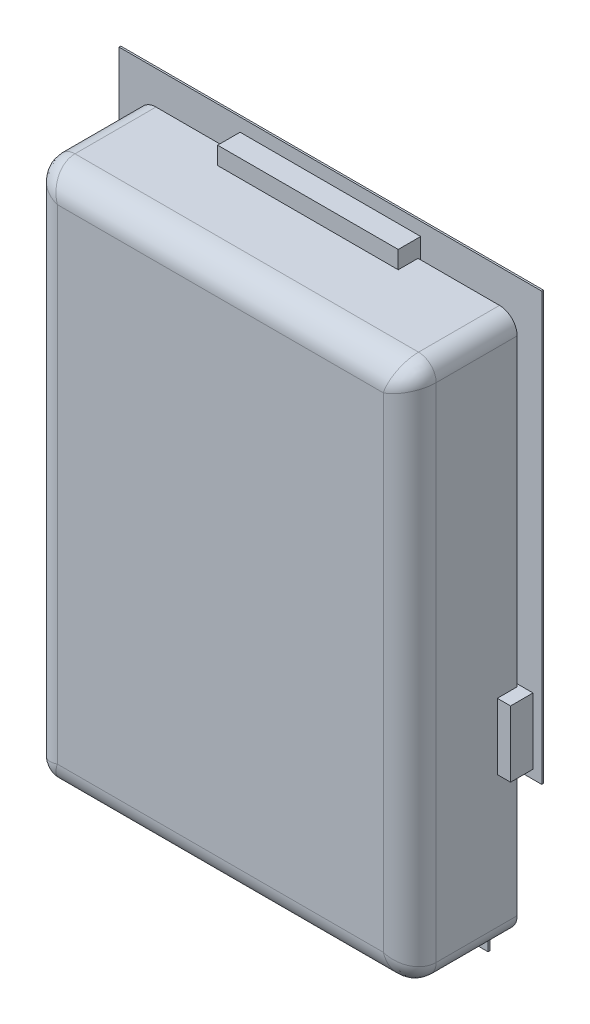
ISO-10303-21;
HEADER;
FILE_DESCRIPTION(('STEP AP214'),'2;1');
FILE_NAME('part.step','',(''),(''),'','','');
FILE_SCHEMA(('AUTOMOTIVE_DESIGN { 1 0 10303 214 1 1 1 1 }'));
ENDSEC;
DATA;
#1=APPLICATION_CONTEXT('core data for automotive mechanical design processes');
#2=APPLICATION_PROTOCOL_DEFINITION('international standard','automotive_design',2000,#1);
#3=PRODUCT_CONTEXT('',#1,'mechanical');
#4=PRODUCT('Part','Part','',(#3));
#5=PRODUCT_RELATED_PRODUCT_CATEGORY('part','',(#4));
#6=PRODUCT_DEFINITION_FORMATION('','',#4);
#7=PRODUCT_DEFINITION_CONTEXT('part definition',#1,'design');
#8=PRODUCT_DEFINITION('design','',#6,#7);
#9=PRODUCT_DEFINITION_SHAPE('','',#8);
#10=(LENGTH_UNIT() NAMED_UNIT(*) SI_UNIT(.MILLI.,.METRE.));
#11=(NAMED_UNIT(*) PLANE_ANGLE_UNIT() SI_UNIT($,.RADIAN.));
#12=(NAMED_UNIT(*) SI_UNIT($,.STERADIAN.) SOLID_ANGLE_UNIT());
#13=UNCERTAINTY_MEASURE_WITH_UNIT(LENGTH_MEASURE(1.E-05),#10,'distance_accuracy_value','');
#14=(GEOMETRIC_REPRESENTATION_CONTEXT(3) GLOBAL_UNCERTAINTY_ASSIGNED_CONTEXT((#13)) GLOBAL_UNIT_ASSIGNED_CONTEXT((#10,
#11,#12)) REPRESENTATION_CONTEXT('',''));
#15=CARTESIAN_POINT('',(0.,0.,0.));
#16=DIRECTION('',(0.,0.,1.));
#17=DIRECTION('',(1.,0.,0.));
#18=AXIS2_PLACEMENT_3D('',#15,#16,#17);
#19=CARTESIAN_POINT('',(0.,-3.0500000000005,0.));
#20=DIRECTION('',(0.,1.,0.));
#21=DIRECTION('',(0.,0.,1.));
#22=AXIS2_PLACEMENT_3D('',#19,#20,#21);
#23=PLANE('',#22);
#24=DIRECTION('',(1.,0.,0.));
#25=VECTOR('',#24,1.);
#26=CARTESIAN_POINT('',(0.,-3.0500000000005,0.126200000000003));
#27=LINE('',#26,#25);
#28=CARTESIAN_POINT('',(-1.66499999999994,-3.0500000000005,0.126200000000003));
#29=VERTEX_POINT('',#28);
#30=CARTESIAN_POINT('',(-1.95000000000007,-3.0500000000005,0.126200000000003));
#31=VERTEX_POINT('',#30);
#32=EDGE_CURVE('E618',#29,#31,#27,.F.);
#33=ORIENTED_EDGE('',*,*,#32,.F.);
#34=DIRECTION('',(0.,0.,1.));
#35=VECTOR('',#34,1.);
#36=CARTESIAN_POINT('',(-1.66499999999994,-3.0500000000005,0.));
#37=LINE('',#36,#35);
#38=CARTESIAN_POINT('',(-1.66499999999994,-3.0500000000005,0.351199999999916));
#39=VERTEX_POINT('',#38);
#40=EDGE_CURVE('E626',#39,#29,#37,.F.);
#41=ORIENTED_EDGE('',*,*,#40,.F.);
#42=DIRECTION('',(1.,0.,0.));
#43=VECTOR('',#42,1.);
#44=CARTESIAN_POINT('',(0.,-3.0500000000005,0.351199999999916));
#45=LINE('',#44,#43);
#46=CARTESIAN_POINT('',(-0.464999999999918,-3.0500000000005,0.351199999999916));
#47=VERTEX_POINT('',#46);
#48=EDGE_CURVE('E636',#47,#39,#45,.F.);
#49=ORIENTED_EDGE('',*,*,#48,.F.);
#50=DIRECTION('',(0.,0.,1.));
#51=VECTOR('',#50,1.);
#52=CARTESIAN_POINT('',(-0.464999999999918,-3.0500000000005,0.));
#53=LINE('',#52,#51);
#54=CARTESIAN_POINT('',(-0.464999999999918,-3.0500000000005,0.126200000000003));
#55=VERTEX_POINT('',#54);
#56=EDGE_CURVE('E647',#55,#47,#53,.T.);
#57=ORIENTED_EDGE('',*,*,#56,.F.);
#58=DIRECTION('',(1.,0.,0.));
#59=VECTOR('',#58,1.);
#60=CARTESIAN_POINT('',(0.,-3.0500000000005,0.126200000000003));
#61=LINE('',#60,#59);
#62=CARTESIAN_POINT('',(0.464999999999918,-3.0500000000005,0.126200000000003));
#63=VERTEX_POINT('',#62);
#64=EDGE_CURVE('E658',#63,#55,#61,.F.);
#65=ORIENTED_EDGE('',*,*,#64,.F.);
#66=DIRECTION('',(0.,0.,1.));
#67=VECTOR('',#66,1.);
#68=CARTESIAN_POINT('',(0.464999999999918,-3.0500000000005,0.));
#69=LINE('',#68,#67);
#70=CARTESIAN_POINT('',(0.464999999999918,-3.0500000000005,0.351199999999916));
#71=VERTEX_POINT('',#70);
#72=EDGE_CURVE('E668',#71,#63,#69,.F.);
#73=ORIENTED_EDGE('',*,*,#72,.F.);
#74=DIRECTION('',(1.,0.,0.));
#75=VECTOR('',#74,1.);
#76=CARTESIAN_POINT('',(0.,-3.0500000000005,0.351199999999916));
#77=LINE('',#76,#75);
#78=CARTESIAN_POINT('',(1.66499999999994,-3.0500000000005,0.351199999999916));
#79=VERTEX_POINT('',#78);
#80=EDGE_CURVE('E676',#79,#71,#77,.F.);
#81=ORIENTED_EDGE('',*,*,#80,.F.);
#82=DIRECTION('',(0.,0.,1.));
#83=VECTOR('',#82,1.);
#84=CARTESIAN_POINT('',(1.66499999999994,-3.0500000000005,0.));
#85=LINE('',#84,#83);
#86=CARTESIAN_POINT('',(1.66499999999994,-3.0500000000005,0.126200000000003));
#87=VERTEX_POINT('',#86);
#88=EDGE_CURVE('E687',#87,#79,#85,.T.);
#89=ORIENTED_EDGE('',*,*,#88,.F.);
#90=DIRECTION('',(1.,0.,0.));
#91=VECTOR('',#90,1.);
#92=CARTESIAN_POINT('',(0.,-3.0500000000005,0.126200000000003));
#93=LINE('',#92,#91);
#94=CARTESIAN_POINT('',(1.94999999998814,-3.0500000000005,0.126200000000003));
#95=VERTEX_POINT('',#94);
#96=EDGE_CURVE('E696',#95,#87,#93,.F.);
#97=ORIENTED_EDGE('',*,*,#96,.F.);
#98=DIRECTION('',(0.,0.,1.));
#99=VECTOR('',#98,1.);
#100=CARTESIAN_POINT('',(1.9499999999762,-3.0500000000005,0.));
#101=LINE('',#100,#99);
#102=CARTESIAN_POINT('',(1.94999999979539,-3.04999277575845,1.04539998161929));
#103=VERTEX_POINT('',#102);
#104=EDGE_CURVE('E377',#103,#95,#101,.F.);
#105=ORIENTED_EDGE('',*,*,#104,.F.);
#106=DIRECTION('',(-1.,0.,0.));
#107=VECTOR('',#106,1.);
#108=CARTESIAN_POINT('',(8.65728000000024,-3.04999999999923,1.04539999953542));
#109=LINE('',#108,#107);
#110=CARTESIAN_POINT('',(-1.94999977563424,-3.04999816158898,1.04540076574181));
#111=VERTEX_POINT('',#110);
#112=EDGE_CURVE('E852',#111,#103,#109,.F.);
#113=ORIENTED_EDGE('',*,*,#112,.F.);
#114=DIRECTION('',(0.,0.,1.));
#115=VECTOR('',#114,1.);
#116=CARTESIAN_POINT('',(-1.95000000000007,-3.0500000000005,0.));
#117=LINE('',#116,#115);
#118=EDGE_CURVE('E625',#31,#111,#117,.T.);
#119=ORIENTED_EDGE('',*,*,#118,.F.);
#120=EDGE_LOOP('',(#33,#41,#49,#57,#65,#73,#81,#89,#97,#105,#113,#119));
#121=FACE_BOUND('',#120,.T.);
#122=ADVANCED_FACE('F16',(#121),#23,.F.);
#123=CARTESIAN_POINT('',(0.,0.,0.0762));
#124=DIRECTION('',(0.,0.,-1.));
#125=DIRECTION('',(-1.,0.,0.));
#126=AXIS2_PLACEMENT_3D('',#123,#124,#125);
#127=PLANE('',#126);
#128=DIRECTION('',(0.,1.,0.));
#129=VECTOR('',#128,1.);
#130=CARTESIAN_POINT('',(1.78999999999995,-3.3999999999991,0.0762));
#131=LINE('',#130,#129);
#132=CARTESIAN_POINT('',(1.78999999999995,-3.3999999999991,0.0762));
#133=VERTEX_POINT('',#132);
#134=CARTESIAN_POINT('',(1.78999999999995,-2.05999999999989,0.0762));
#135=VERTEX_POINT('',#134);
#136=EDGE_CURVE('E865',#133,#135,#131,.T.);
#137=ORIENTED_EDGE('',*,*,#136,.F.);
#138=DIRECTION('',(1.,0.,0.));
#139=VECTOR('',#138,1.);
#140=CARTESIAN_POINT('',(0.33999999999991,-3.3999999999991,0.0762));
#141=LINE('',#140,#139);
#142=CARTESIAN_POINT('',(0.33999999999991,-3.3999999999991,0.0762));
#143=VERTEX_POINT('',#142);
#144=EDGE_CURVE('E1029',#143,#133,#141,.T.);
#145=ORIENTED_EDGE('',*,*,#144,.F.);
#146=DIRECTION('',(0.,1.,0.));
#147=VECTOR('',#146,1.);
#148=CARTESIAN_POINT('',(0.33999999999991,-2.05999999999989,0.0762));
#149=LINE('',#148,#147);
#150=CARTESIAN_POINT('',(0.33999999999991,-2.05999999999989,0.0762));
#151=VERTEX_POINT('',#150);
#152=EDGE_CURVE('E1038',#151,#143,#149,.F.);
#153=ORIENTED_EDGE('',*,*,#152,.F.);
#154=DIRECTION('',(1.,0.,0.));
#155=VECTOR('',#154,1.);
#156=CARTESIAN_POINT('',(1.78999999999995,-2.05999999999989,0.0762));
#157=LINE('',#156,#155);
#158=EDGE_CURVE('E1043',#135,#151,#157,.F.);
#159=ORIENTED_EDGE('',*,*,#158,.F.);
#160=EDGE_LOOP('',(#137,#145,#153,#159));
#161=FACE_BOUND('',#160,.T.);
#162=ADVANCED_FACE('F1772',(#161),#127,.T.);
#163=CARTESIAN_POINT('',(0.,0.,0.0762));
#164=DIRECTION('',(0.,0.,-1.));
#165=DIRECTION('',(-1.,0.,0.));
#166=AXIS2_PLACEMENT_3D('',#163,#164,#165);
#167=PLANE('',#166);
#168=DIRECTION('',(0.,1.,0.));
#169=VECTOR('',#168,1.);
#170=CARTESIAN_POINT('',(-0.33999999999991,-3.3999999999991,0.0762));
#171=LINE('',#170,#169);
#172=CARTESIAN_POINT('',(-0.33999999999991,-3.3999999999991,0.0762));
#173=VERTEX_POINT('',#172);
#174=CARTESIAN_POINT('',(-0.33999999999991,-2.05999999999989,0.0762));
#175=VERTEX_POINT('',#174);
#176=EDGE_CURVE('E1027',#173,#175,#171,.T.);
#177=ORIENTED_EDGE('',*,*,#176,.F.);
#178=DIRECTION('',(1.,0.,0.));
#179=VECTOR('',#178,1.);
#180=CARTESIAN_POINT('',(-1.78999999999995,-3.3999999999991,0.0762));
#181=LINE('',#180,#179);
#182=CARTESIAN_POINT('',(-1.78999999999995,-3.3999999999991,0.0762));
#183=VERTEX_POINT('',#182);
#184=EDGE_CURVE('E1006',#183,#173,#181,.T.);
#185=ORIENTED_EDGE('',*,*,#184,.F.);
#186=DIRECTION('',(0.,1.,0.));
#187=VECTOR('',#186,1.);
#188=CARTESIAN_POINT('',(-1.78999999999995,-2.05999999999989,0.0762));
#189=LINE('',#188,#187);
#190=CARTESIAN_POINT('',(-1.78999999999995,-2.05999999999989,0.0762));
#191=VERTEX_POINT('',#190);
#192=EDGE_CURVE('E1017',#191,#183,#189,.F.);
#193=ORIENTED_EDGE('',*,*,#192,.F.);
#194=DIRECTION('',(1.,0.,0.));
#195=VECTOR('',#194,1.);
#196=CARTESIAN_POINT('',(-0.33999999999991,-2.05999999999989,0.0762));
#197=LINE('',#196,#195);
#198=EDGE_CURVE('E1022',#175,#191,#197,.F.);
#199=ORIENTED_EDGE('',*,*,#198,.F.);
#200=EDGE_LOOP('',(#177,#185,#193,#199));
#201=FACE_BOUND('',#200,.T.);
#202=ADVANCED_FACE('F882',(#201),#167,.T.);
#203=CARTESIAN_POINT('',(8.65728000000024,-2.74999999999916,1.04539999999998));
#204=DIRECTION('',(-1.,0.,0.));
#205=DIRECTION('',(0.,0.,1.));
#206=AXIS2_PLACEMENT_3D('',#203,#204,#205);
#207=CYLINDRICAL_SURFACE('',#206,0.30000000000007);
#208=CARTESIAN_POINT('',(-1.94995205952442,-3.04985356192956,1.03606172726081));
#209=CARTESIAN_POINT('',(-1.95016125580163,-3.05048114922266,1.05636197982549));
#210=CARTESIAN_POINT('',(-1.94914346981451,-3.0474278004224,1.09964966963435));
#211=CARTESIAN_POINT('',(-1.94288538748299,-3.02865360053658,1.16338856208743));
#212=CARTESIAN_POINT('',(-1.93153072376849,-2.99458965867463,1.22367840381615));
#213=CARTESIAN_POINT('',(-1.91570730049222,-2.9471194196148,1.27516028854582));
#214=CARTESIAN_POINT('',(-1.89613604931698,-2.88840567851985,1.31471863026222));
#215=CARTESIAN_POINT('',(-1.87377786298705,-2.82133112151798,1.33972232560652));
#216=CARTESIAN_POINT('',(-1.8570461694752,-2.77113604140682,1.34572265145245));
#217=CARTESIAN_POINT('',(-1.84803379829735,-2.74409892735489,1.34536407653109));
#218=CARTESIAN_POINT('',(-1.84704878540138,-2.74114388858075,1.34528258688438));
#219=(BOUNDED_CURVE() B_SPLINE_CURVE(3,(#208,#209,#210,#211,#212,#213,#214,#215,#216,#217,#218),
.UNSPECIFIED.,.F.,.F.) B_SPLINE_CURVE_WITH_KNOTS((4,1,1,1,1,1,1,1,4),(-0.0187396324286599,
0.10202381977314,0.23720536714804,0.37557149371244,0.51808666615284,0.66502191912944,
0.81559463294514,0.96848907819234,0.987228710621),
.UNSPECIFIED.) CURVE() GEOMETRIC_REPRESENTATION_ITEM() RATIONAL_B_SPLINE_CURVE((1.17155998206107,
1.17155998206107,1.17155998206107,1.17155998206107,1.17155998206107,1.17155998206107,
1.17155998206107,1.17155998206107,1.17155998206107,1.17155998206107,1.17155998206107)) REPRESENTATION_ITEM(''));
#220=CARTESIAN_POINT('',(-1.85000012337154,-2.74999995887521,1.34539999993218));
#221=VERTEX_POINT('',#220);
#222=EDGE_CURVE('E856',#221,#111,#219,.F.);
#223=ORIENTED_EDGE('',*,*,#222,.T.);
#224=ORIENTED_EDGE('',*,*,#112,.T.);
#225=CARTESIAN_POINT('',(1.84999999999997,-2.74999999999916,1.34540000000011));
#226=CARTESIAN_POINT('',(1.85151311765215,-2.75441281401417,1.34539559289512));
#227=CARTESIAN_POINT('',(1.8530116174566,-2.75883064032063,1.34529582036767));
#228=CARTESIAN_POINT('',(1.85600564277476,-2.76773470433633,1.34490021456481));
#229=CARTESIAN_POINT('',(1.85750076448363,-2.77222094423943,1.34460137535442));
#230=CARTESIAN_POINT('',(1.86049070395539,-2.78125261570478,1.34379606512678));
#231=CARTESIAN_POINT('',(1.86198515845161,-2.78579788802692,1.34328645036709));
#232=CARTESIAN_POINT('',(1.86497715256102,-2.79493711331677,1.34204903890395));
#233=CARTESIAN_POINT('',(1.86647438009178,-2.79953072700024,1.34131797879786));
#234=CARTESIAN_POINT('',(1.8694756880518,-2.80875509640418,1.33962798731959));
#235=CARTESIAN_POINT('',(1.87097951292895,-2.81338531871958,1.33866568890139));
#236=CARTESIAN_POINT('',(1.87399877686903,-2.82266986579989,1.336504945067));
#237=CARTESIAN_POINT('',(1.87551403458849,-2.827323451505,1.33530307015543));
#238=CARTESIAN_POINT('',(1.87855466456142,-2.83664045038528,1.33265638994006));
#239=CARTESIAN_POINT('',(1.88007984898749,-2.84130296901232,1.33120821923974));
#240=CARTESIAN_POINT('',(1.88313696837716,-2.85062246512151,1.32806247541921));
#241=CARTESIAN_POINT('',(1.88466868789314,-2.85527840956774,1.32636163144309));
#242=CARTESIAN_POINT('',(1.88773530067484,-2.86456911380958,1.3227044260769));
#243=CARTESIAN_POINT('',(1.8892699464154,-2.86920269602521,1.32074486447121));
#244=CARTESIAN_POINT('',(1.89233841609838,-2.87843309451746,1.3165644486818));
#245=CARTESIAN_POINT('',(1.89387195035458,-2.88302857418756,1.31434042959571));
#246=CARTESIAN_POINT('',(1.89693404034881,-2.89216728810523,1.30962590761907));
#247=CARTESIAN_POINT('',(1.89846225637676,-2.89670900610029,1.30713224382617));
#248=CARTESIAN_POINT('',(1.90150652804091,-2.90572473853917,1.30187308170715));
#249=CARTESIAN_POINT('',(1.90302215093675,-2.91019704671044,1.29910440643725));
#250=CARTESIAN_POINT('',(1.90603288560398,-2.91905856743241,1.29328950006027));
#251=CARTESIAN_POINT('',(1.90752744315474,-2.92344583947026,1.29024002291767));
#252=CARTESIAN_POINT('',(1.91048577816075,-2.93212242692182,1.28385716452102));
#253=CARTESIAN_POINT('',(1.91194882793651,-2.9364094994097,1.28052039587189));
#254=CARTESIAN_POINT('',(1.91483653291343,-2.94487089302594,1.27355739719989));
#255=CARTESIAN_POINT('',(1.91626029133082,-2.94904258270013,1.2699275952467));
#256=CARTESIAN_POINT('',(1.91904489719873,-2.95725701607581,1.26237114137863));
#257=CARTESIAN_POINT('',(1.92040444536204,-2.96129680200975,1.25844079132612));
#258=CARTESIAN_POINT('',(1.92301431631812,-2.9690939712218,1.2504127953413));
#259=CARTESIAN_POINT('',(1.92426611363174,-2.97285501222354,1.24631918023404));
#260=CARTESIAN_POINT('',(1.92665549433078,-2.98001301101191,1.23807718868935));
#261=CARTESIAN_POINT('',(1.92779561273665,-2.98341838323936,1.2339368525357));
#262=CARTESIAN_POINT('',(1.92996130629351,-2.98988264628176,1.22563153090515));
#263=CARTESIAN_POINT('',(1.93098960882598,-2.99294985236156,1.22147372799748));
#264=CARTESIAN_POINT('',(1.93293692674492,-2.99875385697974,1.21316594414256));
#265=CARTESIAN_POINT('',(1.93385867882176,-3.00149899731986,1.20902243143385));
#266=CARTESIAN_POINT('',(1.93559072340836,-3.00667274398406,1.20077599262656));
#267=CARTESIAN_POINT('',(1.9364041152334,-3.00910991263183,1.19667909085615));
#268=CARTESIAN_POINT('',(1.93792458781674,-3.01368422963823,1.18855381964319));
#269=CARTESIAN_POINT('',(1.93863483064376,-3.01583000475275,1.1845308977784));
#270=CARTESIAN_POINT('',(1.93995877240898,-3.01984101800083,1.17657640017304));
#271=CARTESIAN_POINT('',(1.94057545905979,-3.02171475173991,1.17264960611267));
#272=CARTESIAN_POINT('',(1.94172606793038,-3.02520234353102,1.16490593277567));
#273=CARTESIAN_POINT('',(1.94226256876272,-3.02682444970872,1.16109314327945));
#274=CARTESIAN_POINT('',(1.94341282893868,-3.03025544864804,1.15253972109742));
#275=CARTESIAN_POINT('',(1.94401708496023,-3.03202515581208,1.14778203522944));
#276=CARTESIAN_POINT('',(1.94514550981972,-3.03529645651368,1.13826511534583));
#277=CARTESIAN_POINT('',(1.94567094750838,-3.03680238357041,1.13350752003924));
#278=CARTESIAN_POINT('',(1.94663236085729,-3.03955277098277,1.12400772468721));
#279=CARTESIAN_POINT('',(1.94706985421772,-3.04080167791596,1.11926696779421));
#280=CARTESIAN_POINT('',(1.94784900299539,-3.04304491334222,1.10981116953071));
#281=CARTESIAN_POINT('',(1.94819228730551,-3.04404353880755,1.10509728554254));
#282=CARTESIAN_POINT('',(1.9487756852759,-3.04579015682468,1.09570147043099));
#283=CARTESIAN_POINT('',(1.94901747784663,-3.04654217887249,1.0910203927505));
#284=CARTESIAN_POINT('',(1.94941122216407,-3.04781208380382,1.08171097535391));
#285=CARTESIAN_POINT('',(1.94956474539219,-3.04833402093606,1.07708325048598));
#286=CARTESIAN_POINT('',(1.94979788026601,-3.0491594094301,1.06790162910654));
#287=CARTESIAN_POINT('',(1.94987893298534,-3.04946709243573,1.06334814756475));
#288=CARTESIAN_POINT('',(1.94998051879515,-3.0498748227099,1.05432965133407));
#289=CARTESIAN_POINT('',(1.95000231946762,-3.04997920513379,1.04986484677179));
#290=CARTESIAN_POINT('',(1.94999999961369,-3.04998555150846,1.04539997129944));
#291=B_SPLINE_CURVE_WITH_KNOTS('',3,(#225,#226,#227,#228,#229,#230,#231,#232,#233,#234,#235,
#236,#237,#238,#239,#240,#241,#242,#243,#244,#245,#246,#247,#248,#249,#250,#251,#252,#253,#254,
#255,#256,#257,#258,#259,#260,#261,#262,#263,#264,#265,#266,#267,#268,#269,#270,#271,#272,#273,
#274,#275,#276,#277,#278,#279,#280,#281,#282,#283,#284,#285,#286,#287,#288,#289,#290),
.UNSPECIFIED.,.F.,.F.,(4,2,2,2,2,2,2,2,2,2,2,2,2,2,2,2,2,2,2,2,2,2,2,2,2,2,2,2,2,2,2,2,4),(0.,
0.0139942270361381,0.0282047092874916,0.042635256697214,0.057289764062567,0.0721721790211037,
0.0872853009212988,0.102624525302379,0.11818314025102,0.133956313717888,0.149942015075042,
0.166141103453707,0.182555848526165,0.199192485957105,0.216062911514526,0.23318468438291,
0.250568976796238,0.267654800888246,0.284089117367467,0.299886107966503,0.315044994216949,
0.329546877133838,0.343384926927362,0.356563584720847,0.369094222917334,0.384423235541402,
0.39947024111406,0.414229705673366,0.428715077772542,0.442950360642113,0.456923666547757,
0.470612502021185,0.484006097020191),.UNSPECIFIED.);
#292=CARTESIAN_POINT('',(1.84999996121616,-2.75000011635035,1.34539999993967));
#293=VERTEX_POINT('',#292);
#294=EDGE_CURVE('E854',#103,#293,#291,.F.);
#295=ORIENTED_EDGE('',*,*,#294,.T.);
#296=DIRECTION('',(1.,0.,0.));
#297=VECTOR('',#296,1.);
#298=CARTESIAN_POINT('',(-2.15000000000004,-2.74999999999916,1.34540000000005));
#299=LINE('',#298,#297);
#300=EDGE_CURVE('E973',#221,#293,#299,.T.);
#301=ORIENTED_EDGE('',*,*,#300,.F.);
#302=EDGE_LOOP('',(#223,#224,#295,#301));
#303=FACE_BOUND('',#302,.T.);
#304=ADVANCED_FACE('F871',(#303),#207,.T.);
#305=CARTESIAN_POINT('',(1.78999999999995,-3.3999999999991,0.0762));
#306=DIRECTION('',(1.,0.,0.));
#307=DIRECTION('',(0.,0.,-1.));
#308=AXIS2_PLACEMENT_3D('',#305,#306,#307);
#309=PLANE('',#308);
#310=DIRECTION('',(0.,0.,-1.));
#311=VECTOR('',#310,1.);
#312=CARTESIAN_POINT('',(1.78999999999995,-3.3999999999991,0.0762));
#313=LINE('',#312,#311);
#314=CARTESIAN_POINT('',(1.78999999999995,-3.3999999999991,0.0961999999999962));
#315=VERTEX_POINT('',#314);
#316=EDGE_CURVE('E1035',#133,#315,#313,.F.);
#317=ORIENTED_EDGE('',*,*,#316,.F.);
#318=ORIENTED_EDGE('',*,*,#136,.T.);
#319=DIRECTION('',(0.,0.,1.));
#320=VECTOR('',#319,1.);
#321=CARTESIAN_POINT('',(1.78999999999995,-2.05999999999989,0.0762));
#322=LINE('',#321,#320);
#323=CARTESIAN_POINT('',(1.78999999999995,-2.05999999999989,0.0961999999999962));
#324=VERTEX_POINT('',#323);
#325=EDGE_CURVE('E1045',#324,#135,#322,.F.);
#326=ORIENTED_EDGE('',*,*,#325,.F.);
#327=DIRECTION('',(0.,1.,0.));
#328=VECTOR('',#327,1.);
#329=CARTESIAN_POINT('',(1.78999999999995,0.,0.0961999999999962));
#330=LINE('',#329,#328);
#331=EDGE_CURVE('E1059',#315,#324,#330,.T.);
#332=ORIENTED_EDGE('',*,*,#331,.F.);
#333=EDGE_LOOP('',(#317,#318,#326,#332));
#334=FACE_BOUND('',#333,.T.);
#335=ADVANCED_FACE('F881',(#334),#309,.T.);
#336=CARTESIAN_POINT('',(1.78999999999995,-2.05999999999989,0.0762));
#337=DIRECTION('',(0.,1.,0.));
#338=DIRECTION('',(0.,0.,1.));
#339=AXIS2_PLACEMENT_3D('',#336,#337,#338);
#340=PLANE('',#339);
#341=ORIENTED_EDGE('',*,*,#325,.T.);
#342=ORIENTED_EDGE('',*,*,#158,.T.);
#343=DIRECTION('',(0.,0.,1.));
#344=VECTOR('',#343,1.);
#345=CARTESIAN_POINT('',(0.33999999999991,-2.05999999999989,0.0762));
#346=LINE('',#345,#344);
#347=CARTESIAN_POINT('',(0.33999999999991,-2.05999999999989,0.0961999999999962));
#348=VERTEX_POINT('',#347);
#349=EDGE_CURVE('E1040',#348,#151,#346,.F.);
#350=ORIENTED_EDGE('',*,*,#349,.F.);
#351=DIRECTION('',(1.,0.,0.));
#352=VECTOR('',#351,1.);
#353=CARTESIAN_POINT('',(0.,-2.05999999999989,0.0961999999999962));
#354=LINE('',#353,#352);
#355=EDGE_CURVE('E1113',#324,#348,#354,.F.);
#356=ORIENTED_EDGE('',*,*,#355,.F.);
#357=EDGE_LOOP('',(#341,#342,#350,#356));
#358=FACE_BOUND('',#357,.T.);
#359=ADVANCED_FACE('F1740',(#358),#340,.T.);
#360=CARTESIAN_POINT('',(0.33999999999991,-2.05999999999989,0.0762));
#361=DIRECTION('',(-1.,0.,0.));
#362=DIRECTION('',(0.,0.,1.));
#363=AXIS2_PLACEMENT_3D('',#360,#361,#362);
#364=PLANE('',#363);
#365=ORIENTED_EDGE('',*,*,#349,.T.);
#366=ORIENTED_EDGE('',*,*,#152,.T.);
#367=DIRECTION('',(0.,0.,-1.));
#368=VECTOR('',#367,1.);
#369=CARTESIAN_POINT('',(0.33999999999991,-3.3999999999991,0.0762));
#370=LINE('',#369,#368);
#371=CARTESIAN_POINT('',(0.33999999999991,-3.3999999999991,0.0961999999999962));
#372=VERTEX_POINT('',#371);
#373=EDGE_CURVE('E1032',#372,#143,#370,.T.);
#374=ORIENTED_EDGE('',*,*,#373,.F.);
#375=DIRECTION('',(0.,1.,0.));
#376=VECTOR('',#375,1.);
#377=CARTESIAN_POINT('',(0.33999999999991,0.,0.0961999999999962));
#378=LINE('',#377,#376);
#379=EDGE_CURVE('E1116',#348,#372,#378,.F.);
#380=ORIENTED_EDGE('',*,*,#379,.F.);
#381=EDGE_LOOP('',(#365,#366,#374,#380));
#382=FACE_BOUND('',#381,.T.);
#383=ADVANCED_FACE('F1730',(#382),#364,.T.);
#384=CARTESIAN_POINT('',(0.33999999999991,-3.3999999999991,0.0762));
#385=DIRECTION('',(0.,-1.,0.));
#386=DIRECTION('',(0.,0.,-1.));
#387=AXIS2_PLACEMENT_3D('',#384,#385,#386);
#388=PLANE('',#387);
#389=ORIENTED_EDGE('',*,*,#373,.T.);
#390=ORIENTED_EDGE('',*,*,#144,.T.);
#391=ORIENTED_EDGE('',*,*,#316,.T.);
#392=DIRECTION('',(1.,0.,0.));
#393=VECTOR('',#392,1.);
#394=CARTESIAN_POINT('',(0.,-3.3999999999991,0.0961999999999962));
#395=LINE('',#394,#393);
#396=EDGE_CURVE('E804',#372,#315,#395,.T.);
#397=ORIENTED_EDGE('',*,*,#396,.F.);
#398=EDGE_LOOP('',(#389,#390,#391,#397));
#399=FACE_BOUND('',#398,.T.);
#400=ADVANCED_FACE('F1720',(#399),#388,.T.);
#401=CARTESIAN_POINT('',(-0.33999999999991,-3.3999999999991,0.0762));
#402=DIRECTION('',(1.,0.,0.));
#403=DIRECTION('',(0.,0.,-1.));
#404=AXIS2_PLACEMENT_3D('',#401,#402,#403);
#405=PLANE('',#404);
#406=DIRECTION('',(0.,0.,-1.));
#407=VECTOR('',#406,1.);
#408=CARTESIAN_POINT('',(-0.33999999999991,-3.3999999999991,0.0762));
#409=LINE('',#408,#407);
#410=CARTESIAN_POINT('',(-0.33999999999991,-3.3999999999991,0.0961999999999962));
#411=VERTEX_POINT('',#410);
#412=EDGE_CURVE('E1014',#173,#411,#409,.F.);
#413=ORIENTED_EDGE('',*,*,#412,.F.);
#414=ORIENTED_EDGE('',*,*,#176,.T.);
#415=DIRECTION('',(0.,0.,1.));
#416=VECTOR('',#415,1.);
#417=CARTESIAN_POINT('',(-0.33999999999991,-2.05999999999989,0.0762));
#418=LINE('',#417,#416);
#419=CARTESIAN_POINT('',(-0.33999999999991,-2.05999999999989,0.0961999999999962));
#420=VERTEX_POINT('',#419);
#421=EDGE_CURVE('E1024',#420,#175,#418,.F.);
#422=ORIENTED_EDGE('',*,*,#421,.F.);
#423=DIRECTION('',(0.,1.,0.));
#424=VECTOR('',#423,1.);
#425=CARTESIAN_POINT('',(-0.33999999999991,0.,0.0961999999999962));
#426=LINE('',#425,#424);
#427=EDGE_CURVE('E835',#411,#420,#426,.T.);
#428=ORIENTED_EDGE('',*,*,#427,.F.);
#429=EDGE_LOOP('',(#413,#414,#422,#428));
#430=FACE_BOUND('',#429,.T.);
#431=ADVANCED_FACE('F1710',(#430),#405,.T.);
#432=CARTESIAN_POINT('',(-0.33999999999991,-2.05999999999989,0.0762));
#433=DIRECTION('',(0.,1.,0.));
#434=DIRECTION('',(0.,0.,1.));
#435=AXIS2_PLACEMENT_3D('',#432,#433,#434);
#436=PLANE('',#435);
#437=ORIENTED_EDGE('',*,*,#421,.T.);
#438=ORIENTED_EDGE('',*,*,#198,.T.);
#439=DIRECTION('',(0.,0.,1.));
#440=VECTOR('',#439,1.);
#441=CARTESIAN_POINT('',(-1.78999999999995,-2.05999999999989,0.0762));
#442=LINE('',#441,#440);
#443=CARTESIAN_POINT('',(-1.78999999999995,-2.05999999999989,0.0961999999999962));
#444=VERTEX_POINT('',#443);
#445=EDGE_CURVE('E1019',#444,#191,#442,.F.);
#446=ORIENTED_EDGE('',*,*,#445,.F.);
#447=DIRECTION('',(1.,0.,0.));
#448=VECTOR('',#447,1.);
#449=CARTESIAN_POINT('',(0.,-2.05999999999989,0.0961999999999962));
#450=LINE('',#449,#448);
#451=EDGE_CURVE('E1123',#420,#444,#450,.F.);
#452=ORIENTED_EDGE('',*,*,#451,.F.);
#453=EDGE_LOOP('',(#437,#438,#446,#452));
#454=FACE_BOUND('',#453,.T.);
#455=ADVANCED_FACE('F1700',(#454),#436,.T.);
#456=CARTESIAN_POINT('',(-1.78999999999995,-2.05999999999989,0.0762));
#457=DIRECTION('',(-1.,0.,0.));
#458=DIRECTION('',(0.,0.,1.));
#459=AXIS2_PLACEMENT_3D('',#456,#457,#458);
#460=PLANE('',#459);
#461=ORIENTED_EDGE('',*,*,#445,.T.);
#462=ORIENTED_EDGE('',*,*,#192,.T.);
#463=DIRECTION('',(0.,0.,-1.));
#464=VECTOR('',#463,1.);
#465=CARTESIAN_POINT('',(-1.78999999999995,-3.3999999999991,0.0762));
#466=LINE('',#465,#464);
#467=CARTESIAN_POINT('',(-1.78999999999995,-3.3999999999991,0.0961999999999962));
#468=VERTEX_POINT('',#467);
#469=EDGE_CURVE('E1011',#468,#183,#466,.T.);
#470=ORIENTED_EDGE('',*,*,#469,.F.);
#471=DIRECTION('',(0.,1.,0.));
#472=VECTOR('',#471,1.);
#473=CARTESIAN_POINT('',(-1.78999999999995,0.,0.0961999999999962));
#474=LINE('',#473,#472);
#475=EDGE_CURVE('E1126',#444,#468,#474,.F.);
#476=ORIENTED_EDGE('',*,*,#475,.F.);
#477=EDGE_LOOP('',(#461,#462,#470,#476));
#478=FACE_BOUND('',#477,.T.);
#479=ADVANCED_FACE('F1690',(#478),#460,.T.);
#480=CARTESIAN_POINT('',(-1.78999999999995,-3.3999999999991,0.0762));
#481=DIRECTION('',(0.,-1.,0.));
#482=DIRECTION('',(0.,0.,-1.));
#483=AXIS2_PLACEMENT_3D('',#480,#481,#482);
#484=PLANE('',#483);
#485=ORIENTED_EDGE('',*,*,#469,.T.);
#486=ORIENTED_EDGE('',*,*,#184,.T.);
#487=ORIENTED_EDGE('',*,*,#412,.T.);
#488=DIRECTION('',(1.,0.,0.));
#489=VECTOR('',#488,1.);
#490=CARTESIAN_POINT('',(0.,-3.3999999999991,0.0961999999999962));
#491=LINE('',#490,#489);
#492=EDGE_CURVE('E1128',#468,#411,#491,.T.);
#493=ORIENTED_EDGE('',*,*,#492,.F.);
#494=EDGE_LOOP('',(#485,#486,#487,#493));
#495=FACE_BOUND('',#494,.T.);
#496=ADVANCED_FACE('F1681',(#495),#484,.T.);
#497=CARTESIAN_POINT('',(-2.15000000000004,-3.0500000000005,1.34540000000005));
#498=DIRECTION('',(0.,0.,1.));
#499=DIRECTION('',(1.,0.,0.));
#500=AXIS2_PLACEMENT_3D('',#497,#498,#499);
#501=PLANE('',#500);
#502=DIRECTION('',(0.,-1.,0.));
#503=VECTOR('',#502,1.);
#504=CARTESIAN_POINT('',(1.84999999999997,14.401080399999,1.34540000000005));
#505=LINE('',#504,#503);
#506=CARTESIAN_POINT('',(1.84999999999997,2.74999999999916,1.34540000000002));
#507=VERTEX_POINT('',#506);
#508=EDGE_CURVE('E966',#507,#293,#505,.T.);
#509=ORIENTED_EDGE('',*,*,#508,.F.);
#510=DIRECTION('',(1.,0.,0.));
#511=VECTOR('',#510,1.);
#512=CARTESIAN_POINT('',(-8.65728000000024,2.74999999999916,1.34540000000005));
#513=LINE('',#512,#511);
#514=CARTESIAN_POINT('',(-1.84999996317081,2.75000011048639,1.34539999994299));
#515=VERTEX_POINT('',#514);
#516=EDGE_CURVE('E362',#515,#507,#513,.T.);
#517=ORIENTED_EDGE('',*,*,#516,.F.);
#518=DIRECTION('',(0.,-1.,0.));
#519=VECTOR('',#518,1.);
#520=CARTESIAN_POINT('',(-1.84999999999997,14.401080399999,1.34540000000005));
#521=LINE('',#520,#519);
#522=EDGE_CURVE('E1133',#221,#515,#521,.F.);
#523=ORIENTED_EDGE('',*,*,#522,.F.);
#524=ORIENTED_EDGE('',*,*,#300,.T.);
#525=EDGE_LOOP('',(#509,#517,#523,#524));
#526=FACE_BOUND('',#525,.T.);
#527=ADVANCED_FACE('F1673',(#526),#501,.T.);
#528=CARTESIAN_POINT('',(1.84999999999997,14.401080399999,1.04539999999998));
#529=DIRECTION('',(0.,-1.,0.));
#530=DIRECTION('',(0.,0.,-1.));
#531=AXIS2_PLACEMENT_3D('',#528,#529,#530);
#532=CYLINDRICAL_SURFACE('',#531,0.30000000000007);
#533=CARTESIAN_POINT('',(2.14985367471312,-2.8499520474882,1.03606011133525));
#534=CARTESIAN_POINT('',(2.15048891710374,-2.85016379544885,1.05659704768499));
#535=CARTESIAN_POINT('',(2.14736571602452,-2.84912272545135,1.10012913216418));
#536=CARTESIAN_POINT('',(2.12837235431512,-2.84279158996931,1.16405037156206));
#537=CARTESIAN_POINT('',(2.09416240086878,-2.83138825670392,1.22426416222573));
#538=CARTESIAN_POINT('',(2.04649217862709,-2.81549817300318,1.27571466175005));
#539=CARTESIAN_POINT('',(1.98754669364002,-2.79584967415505,1.31517483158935));
#540=CARTESIAN_POINT('',(1.92061884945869,-2.77354039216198,1.33985082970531));
#541=CARTESIAN_POINT('',(1.87075948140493,-2.75692060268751,1.3457193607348));
#542=CARTESIAN_POINT('',(1.84409752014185,-2.748033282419,1.34536365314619));
#543=CARTESIAN_POINT('',(1.84114186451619,-2.74704806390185,1.34528185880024));
#544=(BOUNDED_CURVE() B_SPLINE_CURVE(3,(#533,#534,#535,#536,#537,#538,#539,#540,#541,#542,#543),
.UNSPECIFIED.,.F.,.F.) B_SPLINE_CURVE_WITH_KNOTS((4,1,1,1,1,1,1,1,4),(-0.01877643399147,
0.10357754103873,0.23897027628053,0.37754965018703,0.52033864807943,0.66816827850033,
0.81910951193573,0.96987857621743,0.9886550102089),
.UNSPECIFIED.) CURVE() GEOMETRIC_REPRESENTATION_ITEM() RATIONAL_B_SPLINE_CURVE((1.17155952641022,
1.17155952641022,1.17155952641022,1.17155952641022,1.17155952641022,1.17155952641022,
1.17155952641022,1.17155952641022,1.17155952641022,1.17155952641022,1.17155952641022)) REPRESENTATION_ITEM(''));
#545=CARTESIAN_POINT('',(2.14999826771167,-2.84999977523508,1.04540079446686));
#546=VERTEX_POINT('',#545);
#547=EDGE_CURVE('E962',#546,#293,#544,.T.);
#548=ORIENTED_EDGE('',*,*,#547,.F.);
#549=DIRECTION('',(0.,1.,0.));
#550=VECTOR('',#549,1.);
#551=CARTESIAN_POINT('',(2.15000000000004,-3.0500000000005,1.04539999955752));
#552=LINE('',#551,#550);
#553=CARTESIAN_POINT('',(2.14999889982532,2.84999963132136,1.04539999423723));
#554=VERTEX_POINT('',#553);
#555=EDGE_CURVE('E369',#554,#546,#552,.F.);
#556=ORIENTED_EDGE('',*,*,#555,.F.);
#557=CARTESIAN_POINT('',(1.84112110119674,2.74704036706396,1.34528143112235));
#558=CARTESIAN_POINT('',(1.84408391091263,2.74802797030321,1.34536355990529));
#559=CARTESIAN_POINT('',(1.87075407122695,2.75691802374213,1.34571981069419));
#560=CARTESIAN_POINT('',(1.92061902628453,2.77353967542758,1.33985083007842));
#561=CARTESIAN_POINT('',(1.98754728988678,2.79584909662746,1.31517454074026));
#562=CARTESIAN_POINT('',(2.04649253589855,2.81549751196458,1.27571433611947));
#563=CARTESIAN_POINT('',(2.09416265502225,2.8313875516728,1.22426381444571));
#564=CARTESIAN_POINT('',(2.12837246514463,2.84279082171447,1.16405006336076));
#565=CARTESIAN_POINT('',(2.1473665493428,2.84912218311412,1.10012628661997));
#566=CARTESIAN_POINT('',(2.15048933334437,2.85016311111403,1.05659111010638));
#567=CARTESIAN_POINT('',(2.14985340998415,2.84995113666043,1.03605149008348));
#568=(BOUNDED_CURVE() B_SPLINE_CURVE(3,(#557,#558,#559,#560,#561,#562,#563,#564,#565,#566,#567),
.UNSPECIFIED.,.F.,.F.) B_SPLINE_CURVE_WITH_KNOTS((4,1,1,1,1,1,1,1,4),(0.0113278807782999,
0.0301486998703,0.1809177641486,0.3318589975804,0.4796886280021,0.6224776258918,0.761056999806,
0.8964497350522,1.018820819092),
.UNSPECIFIED.) CURVE() GEOMETRIC_REPRESENTATION_ITEM() RATIONAL_B_SPLINE_CURVE((1.17156169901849,
1.17156169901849,1.17156169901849,1.17156169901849,1.17156169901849,1.17156169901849,
1.17156169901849,1.17156169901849,1.17156169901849,1.17156169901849,1.17156169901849)) REPRESENTATION_ITEM(''));
#569=EDGE_CURVE('E951',#507,#554,#568,.T.);
#570=ORIENTED_EDGE('',*,*,#569,.F.);
#571=ORIENTED_EDGE('',*,*,#508,.T.);
#572=EDGE_LOOP('',(#548,#556,#570,#571));
#573=FACE_BOUND('',#572,.T.);
#574=ADVANCED_FACE('F916',(#573),#532,.T.);
#575=CARTESIAN_POINT('',(2.14951942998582,2.83820525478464,1.03642816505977));
#576=CARTESIAN_POINT('',(2.15010452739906,2.8383933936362,1.05614208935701));
#577=CARTESIAN_POINT('',(2.14724108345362,2.8374801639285,1.09789493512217));
#578=CARTESIAN_POINT('',(2.12965045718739,2.83182232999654,1.15977151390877));
#579=CARTESIAN_POINT('',(2.09741902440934,2.82128608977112,1.21904855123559));
#580=CARTESIAN_POINT('',(2.05174126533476,2.80617926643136,1.27068722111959));
#581=CARTESIAN_POINT('',(1.99444945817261,2.7871143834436,1.31121827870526));
#582=CARTESIAN_POINT('',(1.92861640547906,2.76515289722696,1.33755536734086));
#583=CARTESIAN_POINT('',(1.87905307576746,2.74861441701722,1.344799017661));
#584=CARTESIAN_POINT('',(1.85239897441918,2.73971730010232,1.34518191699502));
#585=CARTESIAN_POINT('',(1.84943621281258,2.73872819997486,1.34518190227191));
#586=CARTESIAN_POINT('',(2.15693497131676,2.9663030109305,1.03220260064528));
#587=CARTESIAN_POINT('',(2.15808236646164,2.9667510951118,1.06117982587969));
#588=CARTESIAN_POINT('',(2.15235132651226,2.96444521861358,1.12291817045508));
#589=CARTESIAN_POINT('',(2.11921591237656,2.95144205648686,1.20792538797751));
#590=CARTESIAN_POINT('',(2.06497829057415,2.93145019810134,1.27817570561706));
#591=CARTESIAN_POINT('',(1.99697247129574,2.90780180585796,1.32840990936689));
#592=CARTESIAN_POINT('',(1.92090691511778,2.8823730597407,1.35775905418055));
#593=CARTESIAN_POINT('',(1.84228755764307,2.856617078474,1.36629438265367));
#594=CARTESIAN_POINT('',(1.78880729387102,2.83917155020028,1.35862006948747));
#595=CARTESIAN_POINT('',(1.76164245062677,2.83035146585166,1.35093749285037));
#596=CARTESIAN_POINT('',(1.75864188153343,2.82937869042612,1.35004092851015));
#597=CARTESIAN_POINT('',(2.06611251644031,3.05704066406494,1.03220476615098));
#598=CARTESIAN_POINT('',(2.06745445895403,3.05767287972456,1.06116257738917));
#599=CARTESIAN_POINT('',(2.06069272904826,3.0543805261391,1.1231085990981));
#600=CARTESIAN_POINT('',(2.02263205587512,3.03617432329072,1.20401868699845));
#601=CARTESIAN_POINT('',(1.96376749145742,3.00948460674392,1.26274896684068));
#602=CARTESIAN_POINT('',(1.8952195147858,2.97978582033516,1.29550319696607));
#603=CARTESIAN_POINT('',(1.824742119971,2.9498492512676,1.3042883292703));
#604=CARTESIAN_POINT('',(1.75850992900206,2.921405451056,1.2923073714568));
#605=CARTESIAN_POINT('',(1.71823221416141,2.9033174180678,1.27218550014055));
#606=CARTESIAN_POINT('',(1.69925090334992,2.89455189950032,1.25890391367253));
#607=CARTESIAN_POINT('',(1.69717285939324,2.89359068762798,1.25739859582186));
#608=CARTESIAN_POINT('',(1.93802052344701,3.04950668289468,1.03643320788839));
#609=CARTESIAN_POINT('',(1.93905866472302,3.05012361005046,1.05610192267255));
#610=CARTESIAN_POINT('',(1.93379504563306,3.04691316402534,1.09833838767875));
#611=CARTESIAN_POINT('',(1.90473493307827,3.02913897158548,1.1506739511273));
#612=CARTESIAN_POINT('',(1.86172870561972,3.00300538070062,1.18312419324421));
#613=CARTESIAN_POINT('',(1.81478842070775,2.97380896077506,1.19405712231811));
#614=CARTESIAN_POINT('',(1.77050980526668,2.9442466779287,1.18670061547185));
#615=CARTESIAN_POINT('',(1.73352283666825,2.91602604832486,1.16526128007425));
#616=CARTESIAN_POINT('',(1.71470437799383,2.8979913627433,1.14351821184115));
#617=CARTESIAN_POINT('',(1.70710732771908,2.8892213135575,1.13086265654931));
#618=CARTESIAN_POINT('',(1.70629285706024,2.88825914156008,1.12944503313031));
#619=(BOUNDED_SURFACE() B_SPLINE_SURFACE(3,3,((#575,#576,#577,#578,#579,#580,#581,#582,#583,
#584,#585),(#586,#587,#588,#589,#590,#591,#592,#593,#594,#595,#596),(#597,#598,#599,#600,#601,
#602,#603,#604,#605,#606,#607),(#608,#609,#610,#611,#612,#613,#614,#615,#616,#617,#618)),
.UNSPECIFIED.,.F.,.F.,.F.) B_SPLINE_SURFACE_WITH_KNOTS((4,4),(4,1,1,1,1,1,1,1,4),(0.,1.),
(0.0113278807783,0.1336989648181,0.2690917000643,0.4076710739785,0.5504600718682,
0.6982897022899,0.8492309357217,1.,1.018820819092),
.UNSPECIFIED.) GEOMETRIC_REPRESENTATION_ITEM() RATIONAL_B_SPLINE_SURFACE(((1.201667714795,
1.201667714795,1.201667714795,1.201667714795,1.201667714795,1.201667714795,1.201667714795,
1.201667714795,1.201667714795,1.201667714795,1.201667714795),(0.9327774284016,0.9327774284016,
0.9327774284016,0.9327774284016,0.9327774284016,0.9327774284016,0.9327774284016,0.9327774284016,
0.9327774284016,0.9327774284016,0.9327774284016),(0.9327774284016,0.9327774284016,
0.9327774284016,0.9327774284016,0.9327774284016,0.9327774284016,0.9327774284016,0.9327774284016,
0.9327774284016,0.9327774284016,0.9327774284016),(1.201667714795,1.201667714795,1.201667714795,
1.201667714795,1.201667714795,1.201667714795,1.201667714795,1.201667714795,1.201667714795,
1.201667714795,1.201667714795))) REPRESENTATION_ITEM('') SURFACE());
#620=CARTESIAN_POINT('',(1.94999999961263,3.04998553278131,1.04539997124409));
#621=CARTESIAN_POINT('',(1.95000232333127,3.04997918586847,1.04986354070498));
#622=CARTESIAN_POINT('',(1.94998063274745,3.04987486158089,1.05432704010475));
#623=CARTESIAN_POINT('',(1.94987940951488,3.04946734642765,1.0633433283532));
#624=CARTESIAN_POINT('',(1.94979860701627,3.04915980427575,1.06789590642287));
#625=CARTESIAN_POINT('',(1.9495660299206,3.04833474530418,1.07707613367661));
#626=CARTESIAN_POINT('',(1.94941280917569,3.04781297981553,1.08170336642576));
#627=CARTESIAN_POINT('',(1.94901965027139,3.04654341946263,1.09101220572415));
#628=CARTESIAN_POINT('',(1.94877813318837,3.04579155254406,1.09569319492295));
#629=CARTESIAN_POINT('',(1.94819517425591,3.04404518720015,1.10508920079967));
#630=CARTESIAN_POINT('',(1.94785204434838,3.04304664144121,1.10980336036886));
#631=CARTESIAN_POINT('',(1.94707300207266,3.04080346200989,1.11926003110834));
#632=CARTESIAN_POINT('',(1.94663545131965,3.03955451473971,1.12400138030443));
#633=CARTESIAN_POINT('',(1.94567369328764,3.03680390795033,1.1335026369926));
#634=CARTESIAN_POINT('',(1.94514795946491,3.035297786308,1.13826109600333));
#635=CARTESIAN_POINT('',(1.94401850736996,3.03202593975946,1.14777994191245));
#636=CARTESIAN_POINT('',(1.94341350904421,3.03025586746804,1.15253868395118));
#637=CARTESIAN_POINT('',(1.94226256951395,3.02682576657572,1.16108986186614));
#638=CARTESIAN_POINT('',(1.94172615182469,3.02520511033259,1.1648994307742));
#639=CARTESIAN_POINT('',(1.94057601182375,3.0217202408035,1.17263778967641));
#640=CARTESIAN_POINT('',(1.93995971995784,3.01984774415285,1.1765624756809));
#641=CARTESIAN_POINT('',(1.9386366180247,3.01583892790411,1.18451380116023));
#642=CARTESIAN_POINT('',(1.93792681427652,3.01369407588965,1.18853564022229));
#643=CARTESIAN_POINT('',(1.93640717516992,3.00912121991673,1.19665971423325));
#644=CARTESIAN_POINT('',(1.93559416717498,3.00668455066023,1.20075647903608));
#645=CARTESIAN_POINT('',(1.9338627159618,3.00151131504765,1.20900351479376));
#646=CARTESIAN_POINT('',(1.93294115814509,2.99876614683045,1.21314773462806));
#647=CARTESIAN_POINT('',(1.93099395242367,2.99296150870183,1.22145768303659));
#648=CARTESIAN_POINT('',(1.92996555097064,2.98989365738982,1.22561691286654));
#649=CARTESIAN_POINT('',(1.92779932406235,2.98342744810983,1.23392569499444));
#650=CARTESIAN_POINT('',(1.92665875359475,2.98002073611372,1.23806803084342));
#651=CARTESIAN_POINT('',(1.92426800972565,2.97285933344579,1.24631447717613));
#652=CARTESIAN_POINT('',(1.92301528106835,2.96909619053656,1.25041050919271));
#653=CARTESIAN_POINT('',(1.92040471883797,2.9612985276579,1.25843901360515));
#654=CARTESIAN_POINT('',(1.91904549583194,2.95726056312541,1.26236768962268));
#655=CARTESIAN_POINT('',(1.91626164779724,2.94904966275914,1.26992126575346));
#656=CARTESIAN_POINT('',(1.91483831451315,2.94487967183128,1.27354984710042));
#657=CARTESIAN_POINT('',(1.91195148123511,2.93642152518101,1.28051081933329));
#658=CARTESIAN_POINT('',(1.91048887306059,2.93213598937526,1.28384676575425));
#659=CARTESIAN_POINT('',(1.90753142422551,2.92346227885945,1.29022834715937));
#660=CARTESIAN_POINT('',(1.90603730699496,2.91907633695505,1.29327735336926));
#661=CARTESIAN_POINT('',(1.90302742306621,2.91021724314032,1.29909163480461));
#662=CARTESIAN_POINT('',(1.90151220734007,2.90574602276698,1.3018601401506));
#663=CARTESIAN_POINT('',(1.89846869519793,2.89673220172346,1.30711922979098));
#664=CARTESIAN_POINT('',(1.896940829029,2.89219129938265,1.30961297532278));
#665=CARTESIAN_POINT('',(1.89387936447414,2.88305393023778,1.31432787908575));
#666=CARTESIAN_POINT('',(1.89234610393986,2.8784589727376,1.31655218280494));
#667=CARTESIAN_POINT('',(1.88927810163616,2.86922931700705,1.32073333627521));
#668=CARTESIAN_POINT('',(1.88774364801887,2.86459594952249,1.32269333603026));
#669=CARTESIAN_POINT('',(1.88467733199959,2.85530536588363,1.32635153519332));
#670=CARTESIAN_POINT('',(1.88314571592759,2.85064932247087,1.32805292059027));
#671=CARTESIAN_POINT('',(1.88008871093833,2.84132931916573,1.33119981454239));
#672=CARTESIAN_POINT('',(1.87856353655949,2.83666638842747,1.33264858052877));
#673=CARTESIAN_POINT('',(1.87552282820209,2.82734826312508,1.33529646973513));
#674=CARTESIAN_POINT('',(1.8740074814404,2.82269396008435,1.33649894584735));
#675=CARTESIAN_POINT('',(1.87098794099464,2.81340768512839,1.33866086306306));
#676=CARTESIAN_POINT('',(1.86948392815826,2.80877645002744,1.33962372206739));
#677=CARTESIAN_POINT('',(1.86648209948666,2.79954977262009,1.34131476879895));
#678=CARTESIAN_POINT('',(1.86498453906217,2.79495486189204,1.34204631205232));
#679=CARTESIAN_POINT('',(1.86199168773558,2.78581276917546,1.34328459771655));
#680=CARTESIAN_POINT('',(1.86049670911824,2.78126592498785,1.34379459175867));
#681=CARTESIAN_POINT('',(1.85750548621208,2.77223084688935,1.34460054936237));
#682=CARTESIAN_POINT('',(1.8560096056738,2.76774277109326,1.34489964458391));
#683=CARTESIAN_POINT('',(1.85301378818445,2.75883478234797,1.34529564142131));
#684=CARTESIAN_POINT('',(1.85151425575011,2.7544148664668,1.34539553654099));
#685=CARTESIAN_POINT('',(1.84999999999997,2.74999999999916,1.34539999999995));
#686=B_SPLINE_CURVE_WITH_KNOTS('',3,(#620,#621,#622,#623,#624,#625,#626,#627,#628,#629,#630,
#631,#632,#633,#634,#635,#636,#637,#638,#639,#640,#641,#642,#643,#644,#645,#646,#647,#648,#649,
#650,#651,#652,#653,#654,#655,#656,#657,#658,#659,#660,#661,#662,#663,#664,#665,#666,#667,#668,
#669,#670,#671,#672,#673,#674,#675,#676,#677,#678,#679,#680,#681,#682,#683,#684,#685),
.UNSPECIFIED.,.F.,.F.,(4,2,2,2,2,2,2,2,2,2,2,2,2,2,2,2,2,2,2,2,2,2,2,2,2,2,2,2,2,2,2,2,4),(0.,
0.0133896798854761,0.0270757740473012,0.0410475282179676,0.0552824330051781,0.0697685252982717,
0.084529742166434,0.099579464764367,0.114912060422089,0.127432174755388,0.140603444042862,
0.15443717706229,0.168937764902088,0.184098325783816,0.199899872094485,0.2163414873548,
0.233437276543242,0.250814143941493,0.267929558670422,0.284794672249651,0.301427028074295,
0.317838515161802,0.334035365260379,0.350019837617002,0.365792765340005,0.381352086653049,
0.396692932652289,0.41180854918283,0.426694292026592,0.441352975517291,0.455788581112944,
0.470005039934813,0.48400619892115),.UNSPECIFIED.);
#687=CARTESIAN_POINT('',(1.94999999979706,3.04999273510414,1.04539931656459));
#688=VERTEX_POINT('',#687);
#689=EDGE_CURVE('E466',#507,#688,#686,.F.);
#690=CARTESIAN_POINT('',(2.14965150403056,2.83824795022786,1.04540015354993));
#691=CARTESIAN_POINT('',(2.15719116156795,2.966400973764,1.04539846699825));
#692=CARTESIAN_POINT('',(2.06641071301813,3.05717777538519,1.04539727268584));
#693=CARTESIAN_POINT('',(1.93825041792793,3.04964054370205,1.04539737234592));
#694=(BOUNDED_CURVE() B_SPLINE_CURVE(3,(#690,#691,#692,#693),.UNSPECIFIED.,.F.,
.F.) B_SPLINE_CURVE_WITH_KNOTS((4,4),(0.,1.),
.UNSPECIFIED.) CURVE() GEOMETRIC_REPRESENTATION_ITEM() RATIONAL_B_SPLINE_CURVE((1.201667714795,
0.9327774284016,0.9327774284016,1.201667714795)) REPRESENTATION_ITEM(''));
#695=EDGE_CURVE('E419',#688,#554,#694,.F.);
#696=ORIENTED_EDGE('',*,*,#689,.F.);
#697=ORIENTED_EDGE('',*,*,#569,.T.);
#698=ORIENTED_EDGE('',*,*,#695,.F.);
#699=EDGE_LOOP('',(#696,#697,#698));
#700=FACE_BOUND('',#699,.T.);
#701=ADVANCED_FACE('F903',(#700),#619,.T.);
#702=CARTESIAN_POINT('',(1.84945765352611,-2.73873522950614,1.34518175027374));
#703=CARTESIAN_POINT('',(1.85241325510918,-2.739721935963,1.34518162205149));
#704=CARTESIAN_POINT('',(1.87905913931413,-2.74861629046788,1.34479834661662));
#705=CARTESIAN_POINT('',(1.92861688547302,-2.76515292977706,1.33755518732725));
#706=CARTESIAN_POINT('',(1.99444943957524,-2.78711424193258,1.3112182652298));
#707=CARTESIAN_POINT('',(2.0517413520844,-2.80617916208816,1.2706871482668));
#708=CARTESIAN_POINT('',(2.09741905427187,-2.82128596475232,1.21904848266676));
#709=CARTESIAN_POINT('',(2.12965046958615,-2.83182219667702,1.15977147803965));
#710=CARTESIAN_POINT('',(2.14724032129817,-2.8374797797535,1.09789751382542));
#711=CARTESIAN_POINT('',(2.15010413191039,-2.83839312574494,1.05614775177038));
#712=CARTESIAN_POINT('',(2.14951966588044,-2.8382051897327,1.0364364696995));
#713=CARTESIAN_POINT('',(1.75866360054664,-2.82938559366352,1.35004732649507));
#714=CARTESIAN_POINT('',(1.76165698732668,-2.83035607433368,1.35094158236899));
#715=CARTESIAN_POINT('',(1.78881372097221,-2.83917372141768,1.35862129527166));
#716=CARTESIAN_POINT('',(1.84228807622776,-2.85661710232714,1.36629442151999));
#717=CARTESIAN_POINT('',(1.92090688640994,-2.88237297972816,1.3577591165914));
#718=CARTESIAN_POINT('',(1.99697259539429,-2.9078017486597,1.32840994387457));
#719=CARTESIAN_POINT('',(2.06497837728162,-2.93145012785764,1.27817571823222));
#720=CARTESIAN_POINT('',(2.1192160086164,-2.95144198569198,1.20792541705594));
#721=CARTESIAN_POINT('',(2.15234997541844,-2.96444456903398,1.12292176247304));
#722=CARTESIAN_POINT('',(2.15808170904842,-2.9667507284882,1.06118817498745));
#723=CARTESIAN_POINT('',(2.15693553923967,-2.96630312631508,1.03221479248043));
#724=CARTESIAN_POINT('',(1.69718791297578,-2.89359752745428,1.25740940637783));
#725=CARTESIAN_POINT('',(1.69926105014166,-2.89455651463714,1.25891099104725));
#726=CARTESIAN_POINT('',(1.71823694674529,-2.90331982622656,1.2721881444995));
#727=CARTESIAN_POINT('',(1.7585103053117,-2.92140549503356,1.2923075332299));
#728=CARTESIAN_POINT('',(1.82474205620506,-2.94984924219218,1.30428837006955));
#729=CARTESIAN_POINT('',(1.89521958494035,-2.97978582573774,1.29550326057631));
#730=CARTESIAN_POINT('',(1.96376754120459,-3.00948460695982,1.26274900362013));
#731=CARTESIAN_POINT('',(2.02263212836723,-3.03617433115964,1.20401873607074));
#732=CARTESIAN_POINT('',(2.06069113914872,-3.05437972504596,1.12311203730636));
#733=CARTESIAN_POINT('',(2.06745366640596,-3.05767248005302,1.06117093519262));
#734=CARTESIAN_POINT('',(2.06611315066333,-3.057040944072,1.03221694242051));
#735=CARTESIAN_POINT('',(1.70629880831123,-2.88826598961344,1.12945520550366));
#736=CARTESIAN_POINT('',(1.70711141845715,-2.88922593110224,1.13086936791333));
#737=CARTESIAN_POINT('',(1.71470653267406,-2.89799375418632,1.14352088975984));
#738=CARTESIAN_POINT('',(1.73352302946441,-2.91602609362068,1.16526142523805));
#739=CARTESIAN_POINT('',(1.77050975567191,-2.94424666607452,1.18670057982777));
#740=CARTESIAN_POINT('',(1.81478843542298,-2.97380896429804,1.19405713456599));
#741=CARTESIAN_POINT('',(1.86172870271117,-3.00300537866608,1.18312418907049));
#742=CARTESIAN_POINT('',(1.90473494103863,-3.02913897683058,1.15067396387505));
#743=CARTESIAN_POINT('',(1.93379377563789,-3.0469123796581,1.09834060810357));
#744=CARTESIAN_POINT('',(1.93905800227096,-3.05012321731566,1.0561076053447));
#745=CARTESIAN_POINT('',(1.93802096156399,-3.04950695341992,1.03644147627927));
#746=(BOUNDED_SURFACE() B_SPLINE_SURFACE(3,3,((#702,#703,#704,#705,#706,#707,#708,#709,#710,
#711,#712),(#713,#714,#715,#716,#717,#718,#719,#720,#721,#722,#723),(#724,#725,#726,#727,#728,
#729,#730,#731,#732,#733,#734),(#735,#736,#737,#738,#739,#740,#741,#742,#743,#744,#745)),
.UNSPECIFIED.,.F.,.F.,.F.) B_SPLINE_SURFACE_WITH_KNOTS((4,4),(4,1,1,1,1,1,1,1,4),(0.,1.),
(-0.01877643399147,0.,0.1507690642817,0.3017102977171,0.449539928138,0.5923289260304,
0.7309082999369,0.8663010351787,0.9886550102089),
.UNSPECIFIED.) GEOMETRIC_REPRESENTATION_ITEM() RATIONAL_B_SPLINE_SURFACE(((1.201667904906,
1.201667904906,1.201667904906,1.201667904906,1.201667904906,1.201667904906,1.201667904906,
1.201667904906,1.201667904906,1.201667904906,1.201667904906),(0.9327773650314,0.9327773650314,
0.9327773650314,0.9327773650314,0.9327773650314,0.9327773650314,0.9327773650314,0.9327773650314,
0.9327773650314,0.9327773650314,0.9327773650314),(0.9327773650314,0.9327773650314,
0.9327773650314,0.9327773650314,0.9327773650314,0.9327773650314,0.9327773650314,0.9327773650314,
0.9327773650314,0.9327773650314,0.9327773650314),(1.201667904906,1.201667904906,1.201667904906,
1.201667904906,1.201667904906,1.201667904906,1.201667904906,1.201667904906,1.201667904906,
1.201667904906,1.201667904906))) REPRESENTATION_ITEM('') SURFACE());
#747=CARTESIAN_POINT('',(1.93825042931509,-3.04964055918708,1.04539987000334));
#748=CARTESIAN_POINT('',(2.06641079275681,-3.05717779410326,1.04540095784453));
#749=CARTESIAN_POINT('',(2.15719125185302,-2.96640090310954,1.04540216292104));
#750=CARTESIAN_POINT('',(2.14965149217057,-2.83824780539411,1.04540267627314));
#751=(BOUNDED_CURVE() B_SPLINE_CURVE(3,(#747,#748,#749,#750),.UNSPECIFIED.,.F.,
.F.) B_SPLINE_CURVE_WITH_KNOTS((4,4),(0.,1.),
.UNSPECIFIED.) CURVE() GEOMETRIC_REPRESENTATION_ITEM() RATIONAL_B_SPLINE_CURVE((1.201667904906,
0.9327773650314,0.9327773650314,1.201667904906)) REPRESENTATION_ITEM(''));
#752=EDGE_CURVE('E373',#546,#103,#751,.F.);
#753=ORIENTED_EDGE('',*,*,#547,.T.);
#754=ORIENTED_EDGE('',*,*,#294,.F.);
#755=ORIENTED_EDGE('',*,*,#752,.F.);
#756=EDGE_LOOP('',(#753,#754,#755));
#757=FACE_BOUND('',#756,.T.);
#758=ADVANCED_FACE('F915',(#757),#746,.T.);
#759=CARTESIAN_POINT('',(1.66499999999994,-3.2499999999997,0.0762));
#760=DIRECTION('',(0.,-1.,0.));
#761=DIRECTION('',(0.,0.,-1.));
#762=AXIS2_PLACEMENT_3D('',#759,#760,#761);
#763=PLANE('',#762);
#764=DIRECTION('',(0.,0.,1.));
#765=VECTOR('',#764,1.);
#766=CARTESIAN_POINT('',(0.464999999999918,-3.2499999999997,0.0762));
#767=LINE('',#766,#765);
#768=CARTESIAN_POINT('',(0.464999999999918,-3.2499999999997,0.0961999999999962));
#769=VERTEX_POINT('',#768);
#770=CARTESIAN_POINT('',(0.464999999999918,-3.2499999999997,0.351199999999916));
#771=VERTEX_POINT('',#770);
#772=EDGE_CURVE('E683',#769,#771,#767,.T.);
#773=ORIENTED_EDGE('',*,*,#772,.F.);
#774=DIRECTION('',(1.,0.,0.));
#775=VECTOR('',#774,1.);
#776=CARTESIAN_POINT('',(0.,-3.2499999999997,0.0961999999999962));
#777=LINE('',#776,#775);
#778=CARTESIAN_POINT('',(1.66499999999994,-3.2499999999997,0.0961999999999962));
#779=VERTEX_POINT('',#778);
#780=EDGE_CURVE('E800',#779,#769,#777,.F.);
#781=ORIENTED_EDGE('',*,*,#780,.F.);
#782=DIRECTION('',(0.,0.,-1.));
#783=VECTOR('',#782,1.);
#784=CARTESIAN_POINT('',(1.66499999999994,-3.2499999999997,0.0762));
#785=LINE('',#784,#783);
#786=CARTESIAN_POINT('',(1.66499999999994,-3.2499999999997,0.351199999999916));
#787=VERTEX_POINT('',#786);
#788=EDGE_CURVE('E408',#787,#779,#785,.T.);
#789=ORIENTED_EDGE('',*,*,#788,.F.);
#790=DIRECTION('',(-1.,0.,0.));
#791=VECTOR('',#790,1.);
#792=CARTESIAN_POINT('',(0.,-3.2499999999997,0.351199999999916));
#793=LINE('',#792,#791);
#794=EDGE_CURVE('E797',#787,#771,#793,.T.);
#795=ORIENTED_EDGE('',*,*,#794,.T.);
#796=EDGE_LOOP('',(#773,#781,#789,#795));
#797=FACE_BOUND('',#796,.T.);
#798=ADVANCED_FACE('F796',(#797),#763,.T.);
#799=CARTESIAN_POINT('',(0.,0.,0.351199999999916));
#800=DIRECTION('',(0.,0.,-1.));
#801=DIRECTION('',(-1.,0.,0.));
#802=AXIS2_PLACEMENT_3D('',#799,#800,#801);
#803=PLANE('',#802);
#804=ORIENTED_EDGE('',*,*,#794,.F.);
#805=DIRECTION('',(0.,1.,0.));
#806=VECTOR('',#805,1.);
#807=CARTESIAN_POINT('',(1.66499999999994,-2.16,0.351199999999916));
#808=LINE('',#807,#806);
#809=EDGE_CURVE('E690',#79,#787,#808,.F.);
#810=ORIENTED_EDGE('',*,*,#809,.F.);
#811=ORIENTED_EDGE('',*,*,#80,.T.);
#812=DIRECTION('',(0.,1.,0.));
#813=VECTOR('',#812,1.);
#814=CARTESIAN_POINT('',(0.464999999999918,-3.2499999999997,0.351199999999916));
#815=LINE('',#814,#813);
#816=EDGE_CURVE('E679',#771,#71,#815,.T.);
#817=ORIENTED_EDGE('',*,*,#816,.F.);
#818=EDGE_LOOP('',(#804,#810,#811,#817));
#819=FACE_BOUND('',#818,.T.);
#820=ADVANCED_FACE('F819',(#819),#803,.F.);
#821=CARTESIAN_POINT('',(0.,0.,0.0961999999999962));
#822=DIRECTION('',(0.,0.,1.));
#823=DIRECTION('',(1.,0.,0.));
#824=AXIS2_PLACEMENT_3D('',#821,#822,#823);
#825=PLANE('',#824);
#826=DIRECTION('',(0.,1.,0.));
#827=VECTOR('',#826,1.);
#828=CARTESIAN_POINT('',(1.66499999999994,-2.16,0.0961999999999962));
#829=LINE('',#828,#827);
#830=CARTESIAN_POINT('',(1.66499999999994,-2.16,0.0961999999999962));
#831=VERTEX_POINT('',#830);
#832=EDGE_CURVE('E787',#779,#831,#829,.T.);
#833=ORIENTED_EDGE('',*,*,#832,.F.);
#834=ORIENTED_EDGE('',*,*,#780,.T.);
#835=DIRECTION('',(0.,1.,0.));
#836=VECTOR('',#835,1.);
#837=CARTESIAN_POINT('',(0.464999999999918,-3.2499999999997,0.0961999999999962));
#838=LINE('',#837,#836);
#839=CARTESIAN_POINT('',(0.464999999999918,-2.16,0.0961999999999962));
#840=VERTEX_POINT('',#839);
#841=EDGE_CURVE('E654',#840,#769,#838,.F.);
#842=ORIENTED_EDGE('',*,*,#841,.F.);
#843=DIRECTION('',(1.,0.,0.));
#844=VECTOR('',#843,1.);
#845=CARTESIAN_POINT('',(0.464999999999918,-2.16,0.0961999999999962));
#846=LINE('',#845,#844);
#847=EDGE_CURVE('E783',#831,#840,#846,.F.);
#848=ORIENTED_EDGE('',*,*,#847,.F.);
#849=EDGE_LOOP('',(#833,#834,#842,#848));
#850=FACE_BOUND('',#849,.T.);
#851=ORIENTED_EDGE('',*,*,#379,.T.);
#852=ORIENTED_EDGE('',*,*,#396,.T.);
#853=ORIENTED_EDGE('',*,*,#331,.T.);
#854=ORIENTED_EDGE('',*,*,#355,.T.);
#855=EDGE_LOOP('',(#851,#852,#853,#854));
#856=FACE_BOUND('',#855,.T.);
#857=ADVANCED_FACE('F806',(#850,#856),#825,.T.);
#858=CARTESIAN_POINT('',(-0.464999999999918,-3.2499999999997,0.0762));
#859=DIRECTION('',(0.,-1.,0.));
#860=DIRECTION('',(0.,0.,-1.));
#861=AXIS2_PLACEMENT_3D('',#858,#859,#860);
#862=PLANE('',#861);
#863=DIRECTION('',(0.,0.,1.));
#864=VECTOR('',#863,1.);
#865=CARTESIAN_POINT('',(-1.66499999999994,-3.2499999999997,0.0762));
#866=LINE('',#865,#864);
#867=CARTESIAN_POINT('',(-1.66499999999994,-3.2499999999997,0.0961999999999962));
#868=VERTEX_POINT('',#867);
#869=CARTESIAN_POINT('',(-1.66499999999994,-3.2499999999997,0.351199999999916));
#870=VERTEX_POINT('',#869);
#871=EDGE_CURVE('E643',#868,#870,#866,.T.);
#872=ORIENTED_EDGE('',*,*,#871,.F.);
#873=DIRECTION('',(1.,0.,0.));
#874=VECTOR('',#873,1.);
#875=CARTESIAN_POINT('',(0.,-3.2499999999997,0.0961999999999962));
#876=LINE('',#875,#874);
#877=CARTESIAN_POINT('',(-0.464999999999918,-3.2499999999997,0.0961999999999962));
#878=VERTEX_POINT('',#877);
#879=EDGE_CURVE('E585',#878,#868,#876,.F.);
#880=ORIENTED_EDGE('',*,*,#879,.F.);
#881=DIRECTION('',(0.,0.,-1.));
#882=VECTOR('',#881,1.);
#883=CARTESIAN_POINT('',(-0.464999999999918,-3.2499999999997,0.0762));
#884=LINE('',#883,#882);
#885=CARTESIAN_POINT('',(-0.464999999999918,-3.2499999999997,0.351199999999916));
#886=VERTEX_POINT('',#885);
#887=EDGE_CURVE('E653',#886,#878,#884,.T.);
#888=ORIENTED_EDGE('',*,*,#887,.F.);
#889=DIRECTION('',(-1.,0.,0.));
#890=VECTOR('',#889,1.);
#891=CARTESIAN_POINT('',(0.,-3.2499999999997,0.351199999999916));
#892=LINE('',#891,#890);
#893=EDGE_CURVE('E803',#886,#870,#892,.T.);
#894=ORIENTED_EDGE('',*,*,#893,.T.);
#895=EDGE_LOOP('',(#872,#880,#888,#894));
#896=FACE_BOUND('',#895,.T.);
#897=ADVANCED_FACE('F837',(#896),#862,.T.);
#898=CARTESIAN_POINT('',(0.,0.,0.351199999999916));
#899=DIRECTION('',(0.,0.,-1.));
#900=DIRECTION('',(-1.,0.,0.));
#901=AXIS2_PLACEMENT_3D('',#898,#899,#900);
#902=PLANE('',#901);
#903=ORIENTED_EDGE('',*,*,#893,.F.);
#904=DIRECTION('',(0.,1.,0.));
#905=VECTOR('',#904,1.);
#906=CARTESIAN_POINT('',(-0.464999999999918,-2.16,0.351199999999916));
#907=LINE('',#906,#905);
#908=EDGE_CURVE('E650',#47,#886,#907,.F.);
#909=ORIENTED_EDGE('',*,*,#908,.F.);
#910=ORIENTED_EDGE('',*,*,#48,.T.);
#911=DIRECTION('',(0.,1.,0.));
#912=VECTOR('',#911,1.);
#913=CARTESIAN_POINT('',(-1.66499999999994,-3.2499999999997,0.351199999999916));
#914=LINE('',#913,#912);
#915=EDGE_CURVE('E639',#870,#39,#914,.T.);
#916=ORIENTED_EDGE('',*,*,#915,.F.);
#917=EDGE_LOOP('',(#903,#909,#910,#916));
#918=FACE_BOUND('',#917,.T.);
#919=ADVANCED_FACE('F831',(#918),#902,.F.);
#920=CARTESIAN_POINT('',(0.,0.,0.0961999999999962));
#921=DIRECTION('',(0.,0.,1.));
#922=DIRECTION('',(1.,0.,0.));
#923=AXIS2_PLACEMENT_3D('',#920,#921,#922);
#924=PLANE('',#923);
#925=ORIENTED_EDGE('',*,*,#879,.T.);
#926=DIRECTION('',(0.,1.,0.));
#927=VECTOR('',#926,1.);
#928=CARTESIAN_POINT('',(-1.66499999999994,-3.2499999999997,0.0961999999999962));
#929=LINE('',#928,#927);
#930=CARTESIAN_POINT('',(-1.66499999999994,-2.16,0.0961999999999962));
#931=VERTEX_POINT('',#930);
#932=EDGE_CURVE('E761',#931,#868,#929,.F.);
#933=ORIENTED_EDGE('',*,*,#932,.F.);
#934=DIRECTION('',(1.,0.,0.));
#935=VECTOR('',#934,1.);
#936=CARTESIAN_POINT('',(-1.66499999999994,-2.16,0.0961999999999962));
#937=LINE('',#936,#935);
#938=CARTESIAN_POINT('',(-0.464999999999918,-2.16,0.0961999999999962));
#939=VERTEX_POINT('',#938);
#940=EDGE_CURVE('E768',#939,#931,#937,.F.);
#941=ORIENTED_EDGE('',*,*,#940,.F.);
#942=DIRECTION('',(0.,1.,0.));
#943=VECTOR('',#942,1.);
#944=CARTESIAN_POINT('',(-0.464999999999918,-2.16,0.0961999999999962));
#945=LINE('',#944,#943);
#946=EDGE_CURVE('E773',#878,#939,#945,.T.);
#947=ORIENTED_EDGE('',*,*,#946,.F.);
#948=EDGE_LOOP('',(#925,#933,#941,#947));
#949=FACE_BOUND('',#948,.T.);
#950=ORIENTED_EDGE('',*,*,#475,.T.);
#951=ORIENTED_EDGE('',*,*,#492,.T.);
#952=ORIENTED_EDGE('',*,*,#427,.T.);
#953=ORIENTED_EDGE('',*,*,#451,.T.);
#954=EDGE_LOOP('',(#950,#951,#952,#953));
#955=FACE_BOUND('',#954,.T.);
#956=ADVANCED_FACE('F599',(#949,#955),#924,.T.);
#957=CARTESIAN_POINT('',(-1.83873620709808,-2.74945942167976,1.34518243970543));
#958=CARTESIAN_POINT('',(-1.8397227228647,-2.75241439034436,1.34518202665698));
#959=CARTESIAN_POINT('',(-1.84874233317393,-2.77943508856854,1.34479124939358));
#960=CARTESIAN_POINT('',(-1.86538890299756,-2.82932269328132,1.33740717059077));
#961=CARTESIAN_POINT('',(-1.88739433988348,-2.89528854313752,1.31074342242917));
#962=CARTESIAN_POINT('',(-1.90638023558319,-2.95234603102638,1.27012574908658));
#963=CARTESIAN_POINT('',(-1.92141990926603,-2.9978248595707,1.21846653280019));
#964=CARTESIAN_POINT('',(-1.93190767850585,-3.02991279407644,1.15912593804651));
#965=CARTESIAN_POINT('',(-1.93749810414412,-3.0472970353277,1.09743773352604));
#966=CARTESIAN_POINT('',(-1.93839145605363,-3.05009698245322,1.05592214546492));
#967=CARTESIAN_POINT('',(-1.93820565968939,-3.04951957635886,1.03643801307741));
#968=CARTESIAN_POINT('',(-1.9293868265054,-2.65866514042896,1.35004834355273));
#969=CARTESIAN_POINT('',(-1.93035695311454,-2.66165806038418,1.35094212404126));
#970=CARTESIAN_POINT('',(-1.93929761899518,-2.6891980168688,1.3587277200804));
#971=CARTESIAN_POINT('',(-1.95687248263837,-2.74307037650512,1.36635828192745));
#972=CARTESIAN_POINT('',(-1.98272473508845,-2.821971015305,1.35748314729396));
#973=CARTESIAN_POINT('',(-2.00809406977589,-2.897829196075,1.32791992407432));
#974=CARTESIAN_POINT('',(-2.03168071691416,-2.9656221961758,1.2775466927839));
#975=CARTESIAN_POINT('',(-2.05162217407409,-3.01968761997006,1.20709563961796));
#976=CARTESIAN_POINT('',(-2.06449355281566,-3.05246594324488,1.12224210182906));
#977=CARTESIAN_POINT('',(-2.06674388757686,-3.05806771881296,1.06085658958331));
#978=CARTESIAN_POINT('',(-2.06630290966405,-3.05693517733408,1.03221701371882));
#979=CARTESIAN_POINT('',(-1.99359885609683,-2.5971887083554,1.25741069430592));
#980=CARTESIAN_POINT('',(-1.9945573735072,-2.59926169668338,1.25891176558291));
#981=CARTESIAN_POINT('',(-2.00344211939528,-2.61850659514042,1.27237419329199));
#982=CARTESIAN_POINT('',(-2.02167453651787,-2.6591187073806,1.29256289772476));
#983=CARTESIAN_POINT('',(-2.05025166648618,-2.72569054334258,1.30429965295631));
#984=CARTESIAN_POINT('',(-2.08014268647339,-2.79605388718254,1.29524159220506));
#985=CARTESIAN_POINT('',(-2.10978355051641,-2.86444331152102,1.26227442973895));
#986=CARTESIAN_POINT('',(-2.1364214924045,-2.92316213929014,1.20327057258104));
#987=CARTESIAN_POINT('',(-2.15445030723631,-2.96082945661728,1.12243027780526));
#988=CARTESIAN_POINT('',(-2.15766185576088,-2.96743758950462,1.06083960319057));
#989=CARTESIAN_POINT('',(-2.15704012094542,-2.96611290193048,1.03221912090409));
#990=CARTESIAN_POINT('',(-1.9882672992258,-2.60629873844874,1.12945636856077));
#991=CARTESIAN_POINT('',(-1.98922678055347,-2.60711145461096,1.1308701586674));
#992=CARTESIAN_POINT('',(-1.99811616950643,-2.61481538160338,1.14369906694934));
#993=CARTESIAN_POINT('',(-2.0162939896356,-2.63382373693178,1.16555924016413));
#994=CARTESIAN_POINT('',(-2.04464487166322,-2.67107940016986,1.18689457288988));
#995=CARTESIAN_POINT('',(-2.07416045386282,-2.71534101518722,1.19402744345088));
#996=CARTESIAN_POINT('',(-2.10329863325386,-2.76220874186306,1.18290188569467));
#997=CARTESIAN_POINT('',(-2.12938056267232,-2.80513309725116,1.15021847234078));
#998=CARTESIAN_POINT('',(-2.14698115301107,-2.83390237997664,1.09787594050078));
#999=CARTESIAN_POINT('',(-2.15011289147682,-2.83904583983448,1.05588258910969));
#1000=CARTESIAN_POINT('',(-2.14950616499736,-2.8380209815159,1.03644292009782));
#1001=(BOUNDED_SURFACE() B_SPLINE_SURFACE(3,3,((#957,#958,#959,#960,#961,#962,#963,#964,#965,
#966,#967),(#968,#969,#970,#971,#972,#973,#974,#975,#976,#977,#978),(#979,#980,#981,#982,#983,
#984,#985,#986,#987,#988,#989),(#990,#991,#992,#993,#994,#995,#996,#997,#998,#999,#1000)),
.UNSPECIFIED.,.F.,.F.,.F.) B_SPLINE_SURFACE_WITH_KNOTS((4,4),(4,1,1,1,1,1,1,1,4),(0.,1.),
(-0.01873963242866,0.,0.1528944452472,0.3034671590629,0.4504024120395,0.5929175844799,
0.7312837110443,0.8664652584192,0.987228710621),
.UNSPECIFIED.) GEOMETRIC_REPRESENTATION_ITEM() RATIONAL_B_SPLINE_SURFACE(((1.201667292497,
1.201667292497,1.201667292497,1.201667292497,1.201667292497,1.201667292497,1.201667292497,
1.201667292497,1.201667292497,1.201667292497,1.201667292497),(0.9327775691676,0.9327775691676,
0.9327775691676,0.9327775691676,0.9327775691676,0.9327775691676,0.9327775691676,0.9327775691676,
0.9327775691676,0.9327775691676,0.9327775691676),(0.9327775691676,0.9327775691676,
0.9327775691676,0.9327775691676,0.9327775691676,0.9327775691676,0.9327775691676,0.9327775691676,
0.9327775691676,0.9327775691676,0.9327775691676),(1.201667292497,1.201667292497,1.201667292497,
1.201667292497,1.201667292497,1.201667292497,1.201667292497,1.201667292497,1.201667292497,
1.201667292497,1.201667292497))) REPRESENTATION_ITEM('') SURFACE());
#1002=CARTESIAN_POINT('',(-1.84999999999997,-2.74999999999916,1.34540000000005));
#1003=CARTESIAN_POINT('',(-1.85442281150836,-2.75151813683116,1.34539530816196));
#1004=CARTESIAN_POINT('',(-1.85885073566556,-2.75302136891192,1.34529490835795));
#1005=CARTESIAN_POINT('',(-1.86777455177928,-2.75602414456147,1.34489730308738));
#1006=CARTESIAN_POINT('',(-1.8722704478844,-2.7575232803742,1.34459711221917));
#1007=CARTESIAN_POINT('',(-1.88132092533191,-2.76052055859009,1.34378833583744));
#1008=CARTESIAN_POINT('',(-1.88587535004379,-2.76201833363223,1.34327662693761));
#1009=CARTESIAN_POINT('',(-1.89503229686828,-2.76501632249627,1.34203425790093));
#1010=CARTESIAN_POINT('',(-1.89963448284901,-2.76651622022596,1.34130035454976));
#1011=CARTESIAN_POINT('',(-1.90887534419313,-2.76952223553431,1.33960391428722));
#1012=CARTESIAN_POINT('',(-1.91351349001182,-2.77102809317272,1.33863803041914));
#1013=CARTESIAN_POINT('',(-1.92281318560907,-2.77405097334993,1.33646934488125));
#1014=CARTESIAN_POINT('',(-1.92747399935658,-2.77556781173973,1.33526312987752));
#1015=CARTESIAN_POINT('',(-1.93680470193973,-2.77861160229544,1.33260707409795));
#1016=CARTESIAN_POINT('',(-1.94147369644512,-2.78013836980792,1.33115387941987));
#1017=CARTESIAN_POINT('',(-1.95080534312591,-2.78319853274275,1.32799750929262));
#1018=CARTESIAN_POINT('',(-1.95546696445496,-2.78473171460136,1.3262910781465));
#1019=CARTESIAN_POINT('',(-1.96476814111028,-2.78780111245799,1.32262222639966));
#1020=CARTESIAN_POINT('',(-1.96940652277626,-2.78933708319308,1.32065662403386));
#1021=CARTESIAN_POINT('',(-1.97864559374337,-2.79240797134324,1.31646374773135));
#1022=CARTESIAN_POINT('',(-1.9832449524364,-2.79394260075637,1.31423332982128));
#1023=CARTESIAN_POINT('',(-1.99239048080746,-2.79700664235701,1.30950571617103));
#1024=CARTESIAN_POINT('',(-1.99693514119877,-2.79853571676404,1.30700538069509));
#1025=CARTESIAN_POINT('',(-2.00595580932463,-2.80158151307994,1.30173267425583));
#1026=CARTESIAN_POINT('',(-2.01043011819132,-2.80309780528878,1.29895714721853));
#1027=CARTESIAN_POINT('',(-2.01929468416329,-2.80610962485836,1.29312840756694));
#1028=CARTESIAN_POINT('',(-2.02368300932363,-2.80760460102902,1.29007197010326));
#1029=CARTESIAN_POINT('',(-2.03236074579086,-2.81056345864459,1.2836751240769));
#1030=CARTESIAN_POINT('',(-2.03664792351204,-2.81202661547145,1.28033134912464));
#1031=CARTESIAN_POINT('',(-2.04510859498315,-2.81491415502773,1.27335429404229));
#1032=CARTESIAN_POINT('',(-2.04927946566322,-2.81633764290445,1.26971746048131));
#1033=CARTESIAN_POINT('',(-2.05749143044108,-2.81912150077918,1.2621470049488));
#1034=CARTESIAN_POINT('',(-2.06152957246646,-2.82048057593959,1.2582097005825));
#1035=CARTESIAN_POINT('',(-2.06931427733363,-2.82308639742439,1.25017682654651));
#1036=CARTESIAN_POINT('',(-2.07306497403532,-2.82433481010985,1.24608580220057));
#1037=CARTESIAN_POINT('',(-2.08020329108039,-2.8267177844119,1.23784966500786));
#1038=CARTESIAN_POINT('',(-2.08359929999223,-2.82785487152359,1.23371255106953));
#1039=CARTESIAN_POINT('',(-2.09004577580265,-2.83001465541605,1.22541413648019));
#1040=CARTESIAN_POINT('',(-2.09310453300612,-2.83104007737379,1.22125998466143));
#1041=CARTESIAN_POINT('',(-2.09889269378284,-2.83298213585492,1.21295964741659));
#1042=CARTESIAN_POINT('',(-2.10163040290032,-2.83390149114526,1.2088198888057));
#1043=CARTESIAN_POINT('',(-2.10679031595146,-2.83562919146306,1.20058105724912));
#1044=CARTESIAN_POINT('',(-2.10922104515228,-2.83644061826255,1.19648797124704));
#1045=CARTESIAN_POINT('',(-2.11378338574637,-2.83795750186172,1.18837043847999));
#1046=CARTESIAN_POINT('',(-2.11592359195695,-2.83866610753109,1.18435140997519));
#1047=CARTESIAN_POINT('',(-2.11992423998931,-2.83998700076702,1.17640479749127));
#1048=CARTESIAN_POINT('',(-2.12179315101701,-2.84060226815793,1.17248197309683));
#1049=CARTESIAN_POINT('',(-2.12527179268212,-2.84175018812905,1.16474624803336));
#1050=CARTESIAN_POINT('',(-2.12688974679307,-2.84228541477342,1.16093741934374));
#1051=CARTESIAN_POINT('',(-2.13031147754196,-2.84343264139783,1.15239366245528));
#1052=CARTESIAN_POINT('',(-2.13207615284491,-2.84403512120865,1.14764173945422));
#1053=CARTESIAN_POINT('',(-2.13533820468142,-2.84516008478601,1.13813629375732));
#1054=CARTESIAN_POINT('',(-2.13683988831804,-2.84568383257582,1.13338439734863));
#1055=CARTESIAN_POINT('',(-2.13958255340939,-2.84664218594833,1.12389627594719));
#1056=CARTESIAN_POINT('',(-2.14082796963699,-2.84707830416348,1.11916148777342));
#1057=CARTESIAN_POINT('',(-2.14306502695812,-2.84785525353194,1.10971824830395));
#1058=CARTESIAN_POINT('',(-2.14406096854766,-2.84819771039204,1.10501095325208));
#1059=CARTESIAN_POINT('',(-2.1458028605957,-2.84877996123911,1.09562880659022));
#1060=CARTESIAN_POINT('',(-2.1465528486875,-2.84902143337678,1.09095480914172));
#1061=CARTESIAN_POINT('',(-2.14781886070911,-2.84941425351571,1.08165921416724));
#1062=CARTESIAN_POINT('',(-2.14833892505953,-2.84956717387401,1.07703822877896));
#1063=CARTESIAN_POINT('',(-2.14916121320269,-2.84979924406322,1.06786983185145));
#1064=CARTESIAN_POINT('',(-2.14946764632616,-2.8498798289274,1.06332283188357));
#1065=CARTESIAN_POINT('',(-2.1498737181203,-2.84998074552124,1.05431709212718));
#1066=CARTESIAN_POINT('',(-2.14997766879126,-2.85000233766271,1.04985856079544));
#1067=CARTESIAN_POINT('',(-2.14998409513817,-2.84999999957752,1.04539996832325));
#1068=B_SPLINE_CURVE_WITH_KNOTS('',3,(#1002,#1003,#1004,#1005,#1006,#1007,#1008,#1009,#1010,
#1011,#1012,#1013,#1014,#1015,#1016,#1017,#1018,#1019,#1020,#1021,#1022,#1023,#1024,#1025,#1026,
#1027,#1028,#1029,#1030,#1031,#1032,#1033,#1034,#1035,#1036,#1037,#1038,#1039,#1040,#1041,#1042,
#1043,#1044,#1045,#1046,#1047,#1048,#1049,#1050,#1051,#1052,#1053,#1054,#1055,#1056,#1057,#1058,
#1059,#1060,#1061,#1062,#1063,#1064,#1065,#1066,#1067),.UNSPECIFIED.,.F.,.F.,(4,2,2,2,2,2,2,2,2,
2,2,2,2,2,2,2,2,2,2,2,2,2,2,2,2,2,2,2,2,2,2,2,4),(0.,0.0140274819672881,0.0282694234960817,
0.0427296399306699,0.0574120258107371,0.0723205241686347,0.0874581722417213,0.102820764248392,
0.118401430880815,0.134195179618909,0.150199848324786,0.166416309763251,0.182846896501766,
0.199497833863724,0.216381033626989,0.233514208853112,0.250908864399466,0.267966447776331,
0.284374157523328,0.300146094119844,0.315282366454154,0.329763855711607,0.343583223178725,
0.356744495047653,0.369258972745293,0.38456605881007,0.399592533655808,0.414331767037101,
0.428796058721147,0.443009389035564,0.456961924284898,0.470631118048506,0.484005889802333),.UNSPECIFIED.);
#1069=CARTESIAN_POINT('',(-2.1499920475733,-2.84999999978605,1.04539997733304));
#1070=VERTEX_POINT('',#1069);
#1071=EDGE_CURVE('E1131',#1070,#221,#1068,.F.);
#1072=CARTESIAN_POINT('',(-2.1496391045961,-2.83825054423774,1.04539986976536));
#1073=CARTESIAN_POINT('',(-2.15717628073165,-2.96641060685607,1.04540092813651));
#1074=CARTESIAN_POINT('',(-2.06640028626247,-3.05719087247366,1.04540210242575));
#1075=CARTESIAN_POINT('',(-1.93824828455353,-3.04965131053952,1.04540260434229));
#1076=(BOUNDED_CURVE() B_SPLINE_CURVE(3,(#1072,#1073,#1074,#1075),.UNSPECIFIED.,.F.,
.F.) B_SPLINE_CURVE_WITH_KNOTS((4,4),(0.,1.),
.UNSPECIFIED.) CURVE() GEOMETRIC_REPRESENTATION_ITEM() RATIONAL_B_SPLINE_CURVE((1.201667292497,
0.9327775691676,0.9327775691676,1.201667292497)) REPRESENTATION_ITEM(''));
#1077=EDGE_CURVE('E404',#111,#1070,#1076,.F.);
#1078=ORIENTED_EDGE('',*,*,#222,.F.);
#1079=ORIENTED_EDGE('',*,*,#1071,.F.);
#1080=ORIENTED_EDGE('',*,*,#1077,.F.);
#1081=EDGE_LOOP('',(#1078,#1079,#1080));
#1082=FACE_BOUND('',#1081,.T.);
#1083=ADVANCED_FACE('F587',(#1082),#1001,.T.);
#1084=CARTESIAN_POINT('',(-1.84999999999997,14.401080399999,1.04539999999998));
#1085=DIRECTION('',(0.,-1.,0.));
#1086=DIRECTION('',(0.,0.,-1.));
#1087=AXIS2_PLACEMENT_3D('',#1084,#1085,#1086);
#1088=CYLINDRICAL_SURFACE('',#1087,0.30000000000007);
#1089=CARTESIAN_POINT('',(-2.14985380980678,2.84995205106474,1.03606046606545));
#1090=CARTESIAN_POINT('',(-2.15049431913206,2.85016555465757,1.05676175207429));
#1091=CARTESIAN_POINT('',(-2.14732369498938,2.84910867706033,1.10043969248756));
#1092=CARTESIAN_POINT('',(-2.12820378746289,2.8427353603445,1.16442608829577));
#1093=CARTESIAN_POINT('',(-2.09396273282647,2.83132166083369,1.2245250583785));
#1094=CARTESIAN_POINT('',(-2.04629747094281,2.81543323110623,1.27587525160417));
#1095=CARTESIAN_POINT('',(-1.98737247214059,2.79579156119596,1.31525792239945));
#1096=CARTESIAN_POINT('',(-1.92051194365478,2.77350471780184,1.33986841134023));
#1097=CARTESIAN_POINT('',(-1.87071666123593,2.75690629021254,1.34571892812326));
#1098=CARTESIAN_POINT('',(-1.84409748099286,2.74803323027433,1.34536361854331));
#1099=CARTESIAN_POINT('',(-1.84114180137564,2.74704800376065,1.34528180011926));
#1100=(BOUNDED_CURVE() B_SPLINE_CURVE(3,(#1089,#1090,#1091,#1092,#1093,#1094,#1095,#1096,#1097,
#1098,#1099),.UNSPECIFIED.,.F.,.F.) B_SPLINE_CURVE_WITH_KNOTS((4,1,1,1,1,1,1,1,4),
(-0.01879869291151,0.10468178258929,0.24010129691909,0.37860140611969,0.52146086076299,
0.66935394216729,0.82032017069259,0.97099382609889,0.9897925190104),
.UNSPECIFIED.) CURVE() GEOMETRIC_REPRESENTATION_ITEM() RATIONAL_B_SPLINE_CURVE((1.17155958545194,
1.17155958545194,1.17155958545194,1.17155958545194,1.17155958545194,1.17155958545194,
1.17155958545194,1.17155958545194,1.17155958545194,1.17155958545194,1.17155958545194)) REPRESENTATION_ITEM(''));
#1101=CARTESIAN_POINT('',(-2.14999895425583,2.84999982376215,1.04540043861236));
#1102=VERTEX_POINT('',#1101);
#1103=EDGE_CURVE('E995',#1102,#515,#1100,.T.);
#1104=ORIENTED_EDGE('',*,*,#1103,.F.);
#1105=DIRECTION('',(0.,1.,0.));
#1106=VECTOR('',#1105,1.);
#1107=CARTESIAN_POINT('',(-2.15000000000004,-3.0500000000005,1.04539998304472));
#1108=LINE('',#1107,#1106);
#1109=EDGE_CURVE('E394',#1070,#1102,#1108,.T.);
#1110=ORIENTED_EDGE('',*,*,#1109,.F.);
#1111=ORIENTED_EDGE('',*,*,#1071,.T.);
#1112=ORIENTED_EDGE('',*,*,#522,.T.);
#1113=EDGE_LOOP('',(#1104,#1110,#1111,#1112));
#1114=FACE_BOUND('',#1113,.T.);
#1115=ADVANCED_FACE('F598',(#1114),#1088,.T.);
#1116=CARTESIAN_POINT('',(-1.8494575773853,2.7387351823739,1.3451816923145));
#1117=CARTESIAN_POINT('',(-1.85241320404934,2.7397218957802,1.34518158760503));
#1118=CARTESIAN_POINT('',(-1.8790163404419,2.74860197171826,1.34479910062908));
#1119=CARTESIAN_POINT('',(-1.92851082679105,2.76511750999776,1.33757571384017));
#1120=CARTESIAN_POINT('',(-1.9942788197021,2.78705732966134,1.31130537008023));
#1121=CARTESIAN_POINT('',(-2.05155320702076,2.80611664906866,1.27085039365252));
#1122=CARTESIAN_POINT('',(-2.09722902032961,2.82122334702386,1.21930827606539));
#1123=CARTESIAN_POINT('',(-2.12949300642,2.83177105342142,1.16013861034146));
#1124=CARTESIAN_POINT('',(-2.14720195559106,2.83746768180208,1.09819540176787));
#1125=CARTESIAN_POINT('',(-2.1501091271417,2.8383945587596,1.05630583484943));
#1126=CARTESIAN_POINT('',(-2.14951979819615,2.83820517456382,1.03643680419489));
#1127=CARTESIAN_POINT('',(-1.75866354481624,2.82938552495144,1.3500472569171));
#1128=CARTESIAN_POINT('',(-1.761656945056,2.83035602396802,1.35094154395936));
#1129=CARTESIAN_POINT('',(-1.78877003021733,2.83915959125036,1.35860911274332));
#1130=CARTESIAN_POINT('',(-1.8421713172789,2.85657902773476,1.36628308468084));
#1131=CARTESIAN_POINT('',(-1.92069469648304,2.88230310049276,1.35780354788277));
#1132=CARTESIAN_POINT('',(-1.99671035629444,2.90771288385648,1.3285463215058));
#1133=CARTESIAN_POINT('',(-2.06468072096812,2.9313442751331,1.27845089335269));
#1134=CARTESIAN_POINT('',(-2.11893531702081,2.9513355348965,1.20839095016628));
#1135=CARTESIAN_POINT('',(-2.15227121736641,2.96441137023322,1.12336178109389));
#1136=CARTESIAN_POINT('',(-2.15809120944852,2.96675588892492,1.06142054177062));
#1137=CARTESIAN_POINT('',(-2.15693570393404,2.96630348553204,1.03221534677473));
#1138=CARTESIAN_POINT('',(-1.69718789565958,2.8935974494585,1.25740933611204));
#1139=CARTESIAN_POINT('',(-1.6992610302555,2.89455646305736,1.25891094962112));
#1140=CARTESIAN_POINT('',(-1.7182063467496,2.90330583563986,1.27216692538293));
#1141=CARTESIAN_POINT('',(-1.7584202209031,2.92136554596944,1.29226798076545));
#1142=CARTESIAN_POINT('',(-1.82455623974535,2.94977018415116,1.30427593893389));
#1143=CARTESIAN_POINT('',(-1.89496724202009,2.97967830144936,1.29556914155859));
#1144=CARTESIAN_POINT('',(-1.96345761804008,3.00934813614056,1.26295147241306));
#1145=CARTESIAN_POINT('',(-2.02231814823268,3.03602871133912,1.20443358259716));
#1146=CARTESIAN_POINT('',(-2.06059722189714,3.05433158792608,1.12355322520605));
#1147=CARTESIAN_POINT('',(-2.06746461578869,3.05768028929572,1.06140314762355));
#1148=CARTESIAN_POINT('',(-2.06611328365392,3.05704157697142,1.03221753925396));
#1149=CARTESIAN_POINT('',(-1.70629882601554,2.88826591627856,1.1294551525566));
#1150=CARTESIAN_POINT('',(-1.70711142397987,2.88922588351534,1.13086933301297));
#1151=CARTESIAN_POINT('',(-1.71469422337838,2.89797975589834,1.14350060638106));
#1152=CARTESIAN_POINT('',(-1.73347909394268,2.91598630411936,1.16521625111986));
#1153=CARTESIAN_POINT('',(-1.77040055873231,2.94416837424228,1.1866552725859));
#1154=CARTESIAN_POINT('',(-1.8146233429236,2.97370299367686,1.19405621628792));
#1155=CARTESIAN_POINT('',(-1.86151011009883,3.00287145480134,1.18321467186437));
#1156=CARTESIAN_POINT('',(-1.90449996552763,3.02899661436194,1.1509230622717));
#1157=CARTESIAN_POINT('',(-1.93372011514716,3.04686548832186,1.09864121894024));
#1158=CARTESIAN_POINT('',(-1.9390663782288,3.05013081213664,1.05626532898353));
#1159=CARTESIAN_POINT('',(-1.93802102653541,3.04950756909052,1.03644190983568));
#1160=(BOUNDED_SURFACE() B_SPLINE_SURFACE(3,3,((#1116,#1117,#1118,#1119,#1120,#1121,#1122,#1123,
#1124,#1125,#1126),(#1127,#1128,#1129,#1130,#1131,#1132,#1133,#1134,#1135,#1136,#1137),(#1138,
#1139,#1140,#1141,#1142,#1143,#1144,#1145,#1146,#1147,#1148),(#1149,#1150,#1151,#1152,#1153,
#1154,#1155,#1156,#1157,#1158,#1159)),.UNSPECIFIED.,.F.,.F.,.F.) B_SPLINE_SURFACE_WITH_KNOTS((4,
4),(4,1,1,1,1,1,1,1,4),(0.,1.),(-0.01879869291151,0.,0.1506736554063,0.3016398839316,
0.4495329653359,0.5923924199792,0.7308925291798,0.8663120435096,0.9897925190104),
.UNSPECIFIED.) GEOMETRIC_REPRESENTATION_ITEM() RATIONAL_B_SPLINE_SURFACE(((1.201667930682,
1.201667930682,1.201667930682,1.201667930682,1.201667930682,1.201667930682,1.201667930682,
1.201667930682,1.201667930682,1.201667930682,1.201667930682),(0.9327773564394,0.9327773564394,
0.9327773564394,0.9327773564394,0.9327773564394,0.9327773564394,0.9327773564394,0.9327773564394,
0.9327773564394,0.9327773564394,0.9327773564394),(0.9327773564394,0.9327773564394,
0.9327773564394,0.9327773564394,0.9327773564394,0.9327773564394,0.9327773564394,0.9327773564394,
0.9327773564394,0.9327773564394,0.9327773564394),(1.201667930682,1.201667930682,1.201667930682,
1.201667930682,1.201667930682,1.201667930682,1.201667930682,1.201667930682,1.201667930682,
1.201667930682,1.201667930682))) REPRESENTATION_ITEM('') SURFACE());
#1161=CARTESIAN_POINT('',(-1.9382503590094,3.04964174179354,1.0453998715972));
#1162=CARTESIAN_POINT('',(-2.06641079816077,3.05717901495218,1.04540096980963));
#1163=CARTESIAN_POINT('',(-2.15719136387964,2.96640159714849,1.04540218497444));
#1164=CARTESIAN_POINT('',(-2.14965166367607,2.83824776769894,1.04540270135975));
#1165=(BOUNDED_CURVE() B_SPLINE_CURVE(3,(#1161,#1162,#1163,#1164),.UNSPECIFIED.,.F.,
.F.) B_SPLINE_CURVE_WITH_KNOTS((4,4),(0.,1.),
.UNSPECIFIED.) CURVE() GEOMETRIC_REPRESENTATION_ITEM() RATIONAL_B_SPLINE_CURVE((1.201667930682,
0.9327773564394,0.9327773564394,1.201667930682)) REPRESENTATION_ITEM(''));
#1166=CARTESIAN_POINT('',(-1.9499999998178,3.04999336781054,1.04539998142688));
#1167=VERTEX_POINT('',#1166);
#1168=EDGE_CURVE('E425',#1102,#1167,#1165,.F.);
#1169=CARTESIAN_POINT('',(-1.84999999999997,2.74999999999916,1.34540000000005));
#1170=CARTESIAN_POINT('',(-1.85151314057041,2.75441328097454,1.34539561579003));
#1171=CARTESIAN_POINT('',(-1.85301167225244,2.75883157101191,1.34529583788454));
#1172=CARTESIAN_POINT('',(-1.8560057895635,2.76773657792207,1.3449001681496));
#1173=CARTESIAN_POINT('',(-1.85750097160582,2.77222329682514,1.34460126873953));
#1174=CARTESIAN_POINT('',(-1.86049106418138,2.78125593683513,1.34379578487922));
#1175=CARTESIAN_POINT('',(-1.86198561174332,2.78580169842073,1.34328605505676));
#1176=CARTESIAN_POINT('',(-1.86497782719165,2.79494190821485,1.34204836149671));
#1177=CARTESIAN_POINT('',(-1.86647518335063,2.79953601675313,1.34131713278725));
#1178=CARTESIAN_POINT('',(-1.86947679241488,2.8087613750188,1.33962675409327));
#1179=CARTESIAN_POINT('',(-1.87098079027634,2.81339209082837,1.3386642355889));
#1180=CARTESIAN_POINT('',(-1.87400042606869,2.82267761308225,1.33650300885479));
#1181=CARTESIAN_POINT('',(-1.8755158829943,2.82733168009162,1.33530087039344));
#1182=CARTESIAN_POINT('',(-1.87855688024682,2.83664962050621,1.33265361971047));
#1183=CARTESIAN_POINT('',(-1.88008223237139,2.84131259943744,1.33120514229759));
#1184=CARTESIAN_POINT('',(-1.88313967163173,2.85063298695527,1.32805873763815));
#1185=CARTESIAN_POINT('',(-1.88467154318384,2.8552893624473,1.32635753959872));
#1186=CARTESIAN_POINT('',(-1.88773844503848,2.86458089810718,1.32269957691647));
#1187=CARTESIAN_POINT('',(-1.8892732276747,2.86921488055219,1.32073961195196));
#1188=CARTESIAN_POINT('',(-1.89234197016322,2.87844604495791,1.31655834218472));
#1189=CARTESIAN_POINT('',(-1.89387564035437,2.88304189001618,1.31433387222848));
#1190=CARTESIAN_POINT('',(-1.89693798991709,2.89218129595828,1.3096184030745));
#1191=CARTESIAN_POINT('',(-1.89846632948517,2.89672334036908,1.30712424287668));
#1192=CARTESIAN_POINT('',(-1.9015108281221,2.90573968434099,1.30186403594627));
#1193=CARTESIAN_POINT('',(-1.90302655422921,2.91021227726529,1.29909481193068));
#1194=CARTESIAN_POINT('',(-1.90603749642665,2.91907433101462,1.2932787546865));
#1195=CARTESIAN_POINT('',(-1.90753215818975,2.92346185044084,1.29022867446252));
#1196=CARTESIAN_POINT('',(-1.91049072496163,2.93213890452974,1.28384455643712));
#1197=CARTESIAN_POINT('',(-1.9119539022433,2.9364261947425,1.28050712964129));
#1198=CARTESIAN_POINT('',(-1.91484191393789,2.94488799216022,1.27354278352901));
#1199=CARTESIAN_POINT('',(-1.91626585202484,2.94905986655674,1.26991229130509));
#1200=CARTESIAN_POINT('',(-1.91905067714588,2.95727458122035,1.26235439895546));
#1201=CARTESIAN_POINT('',(-1.92041026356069,2.9613144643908,1.25842330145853));
#1202=CARTESIAN_POINT('',(-1.92301946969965,2.96910969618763,1.25039589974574));
#1203=CARTESIAN_POINT('',(-1.92427060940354,2.97286881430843,1.2463037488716));
#1204=CARTESIAN_POINT('',(-1.92665882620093,2.98002336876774,1.23806465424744));
#1205=CARTESIAN_POINT('',(-1.92779843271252,2.98342720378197,1.23392573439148));
#1206=CARTESIAN_POINT('',(-1.92996332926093,2.98988878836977,1.22562318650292));
#1207=CARTESIAN_POINT('',(-1.93099133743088,2.99295483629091,1.22146672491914));
#1208=CARTESIAN_POINT('',(-1.93293802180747,2.99875678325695,1.21316161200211));
#1209=CARTESIAN_POINT('',(-1.93385943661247,3.00150101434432,1.20901942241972));
#1210=CARTESIAN_POINT('',(-1.93559082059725,3.00667317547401,1.20077549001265));
#1211=CARTESIAN_POINT('',(-1.93640388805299,3.00910965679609,1.19667976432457));
#1212=CARTESIAN_POINT('',(-1.93792377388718,3.01368285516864,1.18855656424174));
#1213=CARTESIAN_POINT('',(-1.93863375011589,3.01582818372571,1.18453452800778));
#1214=CARTESIAN_POINT('',(-1.93995725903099,3.01983856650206,1.17658141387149));
#1215=CARTESIAN_POINT('',(-1.94057377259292,3.02171209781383,1.17265510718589));
#1216=CARTESIAN_POINT('',(-1.94172409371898,3.02519950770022,1.16491200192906));
#1217=CARTESIAN_POINT('',(-1.94226047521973,3.02682161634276,1.16109928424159));
#1218=CARTESIAN_POINT('',(-1.94341052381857,3.03025258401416,1.15254652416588));
#1219=CARTESIAN_POINT('',(-1.9440147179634,3.03202231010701,1.14778945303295));
#1220=CARTESIAN_POINT('',(-1.94514320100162,3.03529368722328,1.13827378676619));
#1221=CARTESIAN_POINT('',(-1.94566875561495,3.03679967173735,1.13351683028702));
#1222=CARTESIAN_POINT('',(-1.94663041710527,3.03955023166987,1.12401801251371));
#1223=CARTESIAN_POINT('',(-1.94706803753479,3.04079924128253,1.11927759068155));
#1224=CARTESIAN_POINT('',(-1.94784728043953,3.04304266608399,1.10982185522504));
#1225=CARTESIAN_POINT('',(-1.94819052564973,3.04404135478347,1.10510769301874));
#1226=CARTESIAN_POINT('',(-1.948773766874,3.04578820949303,1.09571083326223));
#1227=CARTESIAN_POINT('',(-1.9490154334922,3.04654038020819,1.09102898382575));
#1228=CARTESIAN_POINT('',(-1.94940934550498,3.04781092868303,1.08171806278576));
#1229=CARTESIAN_POINT('',(-1.94956315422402,3.04833335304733,1.07708960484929));
#1230=CARTESIAN_POINT('',(-1.9497968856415,3.04915963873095,1.06790640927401));
#1231=CARTESIAN_POINT('',(-1.94987824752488,3.04946772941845,1.06335208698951));
#1232=CARTESIAN_POINT('',(-1.94998031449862,3.04987599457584,1.05433172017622));
#1233=CARTESIAN_POINT('',(-1.95000228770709,3.04998050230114,1.04986588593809));
#1234=CARTESIAN_POINT('',(-1.9499999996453,3.04998673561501,1.04539997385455));
#1235=B_SPLINE_CURVE_WITH_KNOTS('',3,(#1169,#1170,#1171,#1172,#1173,#1174,#1175,#1176,#1177,
#1178,#1179,#1180,#1181,#1182,#1183,#1184,#1185,#1186,#1187,#1188,#1189,#1190,#1191,#1192,#1193,
#1194,#1195,#1196,#1197,#1198,#1199,#1200,#1201,#1202,#1203,#1204,#1205,#1206,#1207,#1208,#1209,
#1210,#1211,#1212,#1213,#1214,#1215,#1216,#1217,#1218,#1219,#1220,#1221,#1222,#1223,#1224,#1225,
#1226,#1227,#1228,#1229,#1230,#1231,#1232,#1233,#1234),.UNSPECIFIED.,.F.,.F.,(4,2,2,2,2,2,2,2,2,
2,2,2,2,2,2,2,2,2,2,2,2,2,2,2,2,2,2,2,2,2,2,2,4),(0.,0.0139955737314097,0.0282074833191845,
0.042639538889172,0.0572956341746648,0.0721797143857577,0.0872945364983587,0.102635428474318,
0.118195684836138,0.133970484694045,0.149957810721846,0.166158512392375,0.182574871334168,
0.19921317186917,0.216085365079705,0.233208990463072,0.250595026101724,0.26767346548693,
0.2841013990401,0.299893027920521,0.315046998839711,0.329544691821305,0.343379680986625,
0.356556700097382,0.369087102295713,0.384414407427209,0.39945968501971,0.414218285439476,
0.428704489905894,0.442942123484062,0.45691782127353,0.470609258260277,0.484005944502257),.UNSPECIFIED.);
#1236=EDGE_CURVE('E500',#1167,#515,#1235,.F.);
#1237=ORIENTED_EDGE('',*,*,#1168,.F.);
#1238=ORIENTED_EDGE('',*,*,#1103,.T.);
#1239=ORIENTED_EDGE('',*,*,#1236,.F.);
#1240=EDGE_LOOP('',(#1237,#1238,#1239));
#1241=FACE_BOUND('',#1240,.T.);
#1242=ADVANCED_FACE('F484',(#1241),#1160,.T.);
#1243=CARTESIAN_POINT('',(-8.65728000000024,2.74999999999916,1.04539999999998));
#1244=DIRECTION('',(1.,0.,0.));
#1245=DIRECTION('',(0.,0.,-1.));
#1246=AXIS2_PLACEMENT_3D('',#1243,#1244,#1245);
#1247=CYLINDRICAL_SURFACE('',#1246,0.30000000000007);
#1248=ORIENTED_EDGE('',*,*,#1236,.T.);
#1249=ORIENTED_EDGE('',*,*,#516,.T.);
#1250=ORIENTED_EDGE('',*,*,#689,.T.);
#1251=DIRECTION('',(1.,0.,0.));
#1252=VECTOR('',#1251,1.);
#1253=CARTESIAN_POINT('',(0.,3.0500000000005,1.04539998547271));
#1254=LINE('',#1253,#1252);
#1255=EDGE_CURVE('E503',#1167,#688,#1254,.T.);
#1256=ORIENTED_EDGE('',*,*,#1255,.F.);
#1257=EDGE_LOOP('',(#1248,#1249,#1250,#1256));
#1258=FACE_BOUND('',#1257,.T.);
#1259=ADVANCED_FACE('F474',(#1258),#1247,.T.);
#1260=CARTESIAN_POINT('',(2.15000000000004,-3.0500000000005,1.34540000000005));
#1261=DIRECTION('',(1.,0.,0.));
#1262=DIRECTION('',(0.,0.,-1.));
#1263=AXIS2_PLACEMENT_3D('',#1260,#1261,#1262);
#1264=PLANE('',#1263);
#1265=DIRECTION('',(0.,0.,-1.));
#1266=VECTOR('',#1265,1.);
#1267=CARTESIAN_POINT('',(2.14999999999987,2.84999972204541,2.99992912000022));
#1268=LINE('',#1267,#1266);
#1269=CARTESIAN_POINT('',(2.14999999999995,2.84999986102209,0.126200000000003));
#1270=VERTEX_POINT('',#1269);
#1271=EDGE_CURVE('E374',#554,#1270,#1268,.T.);
#1272=ORIENTED_EDGE('',*,*,#1271,.F.);
#1273=ORIENTED_EDGE('',*,*,#555,.T.);
#1274=DIRECTION('',(0.,0.,-1.));
#1275=VECTOR('',#1274,1.);
#1276=CARTESIAN_POINT('',(2.15000000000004,-2.84999972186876,1.34540000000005));
#1277=LINE('',#1276,#1275);
#1278=CARTESIAN_POINT('',(2.15000000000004,-2.84999986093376,0.126200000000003));
#1279=VERTEX_POINT('',#1278);
#1280=EDGE_CURVE('E366',#1279,#546,#1277,.F.);
#1281=ORIENTED_EDGE('',*,*,#1280,.F.);
#1282=DIRECTION('',(0.,1.,0.));
#1283=VECTOR('',#1282,1.);
#1284=CARTESIAN_POINT('',(2.15000000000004,-3.0500000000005,0.126200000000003));
#1285=LINE('',#1284,#1283);
#1286=CARTESIAN_POINT('',(2.15000000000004,-1.34999999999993,0.126200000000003));
#1287=VERTEX_POINT('',#1286);
#1288=EDGE_CURVE('E350',#1279,#1287,#1285,.T.);
#1289=ORIENTED_EDGE('',*,*,#1288,.T.);
#1290=DIRECTION('',(0.,0.,-1.));
#1291=VECTOR('',#1290,1.);
#1292=CARTESIAN_POINT('',(2.15000000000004,-1.34999999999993,1.34540000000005));
#1293=LINE('',#1292,#1291);
#1294=CARTESIAN_POINT('',(2.15000000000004,-1.34999999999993,0.351199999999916));
#1295=VERTEX_POINT('',#1294);
#1296=EDGE_CURVE('E361',#1287,#1295,#1293,.F.);
#1297=ORIENTED_EDGE('',*,*,#1296,.T.);
#1298=DIRECTION('',(0.,1.,0.));
#1299=VECTOR('',#1298,1.);
#1300=CARTESIAN_POINT('',(2.15000000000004,-3.0500000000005,0.351199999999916));
#1301=LINE('',#1300,#1299);
#1302=CARTESIAN_POINT('',(2.15000000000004,-0.599999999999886,0.351199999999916));
#1303=VERTEX_POINT('',#1302);
#1304=EDGE_CURVE('E453',#1295,#1303,#1301,.T.);
#1305=ORIENTED_EDGE('',*,*,#1304,.T.);
#1306=DIRECTION('',(0.,0.,-1.));
#1307=VECTOR('',#1306,1.);
#1308=CARTESIAN_POINT('',(2.15000000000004,-0.599999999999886,1.34540000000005));
#1309=LINE('',#1308,#1307);
#1310=CARTESIAN_POINT('',(2.15000000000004,-0.599999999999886,0.126200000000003));
#1311=VERTEX_POINT('',#1310);
#1312=EDGE_CURVE('E451',#1303,#1311,#1309,.T.);
#1313=ORIENTED_EDGE('',*,*,#1312,.T.);
#1314=DIRECTION('',(0.,1.,0.));
#1315=VECTOR('',#1314,1.);
#1316=CARTESIAN_POINT('',(2.15000000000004,-3.0500000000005,0.126200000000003));
#1317=LINE('',#1316,#1315);
#1318=EDGE_CURVE('E457',#1270,#1311,#1317,.F.);
#1319=ORIENTED_EDGE('',*,*,#1318,.F.);
#1320=EDGE_LOOP('',(#1272,#1273,#1281,#1289,#1297,#1305,#1313,#1319));
#1321=FACE_BOUND('',#1320,.T.);
#1322=ADVANCED_FACE('F368',(#1321),#1264,.T.);
#1323=CARTESIAN_POINT('',(1.95000000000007,2.84999999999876,2.99992912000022));
#1324=DIRECTION('',(0.,0.,-1.));
#1325=DIRECTION('',(-1.,0.,0.));
#1326=AXIS2_PLACEMENT_3D('',#1323,#1324,#1325);
#1327=CYLINDRICAL_SURFACE('',#1326,0.199999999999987);
#1328=ORIENTED_EDGE('',*,*,#1271,.T.);
#1329=CARTESIAN_POINT('',(1.95000000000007,2.84999999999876,0.126200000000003));
#1330=DIRECTION('',(0.,0.,-1.));
#1331=DIRECTION('',(-1.,0.,0.));
#1332=AXIS2_PLACEMENT_3D('',#1329,#1330,#1331);
#1333=CIRCLE('',#1332,0.199999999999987);
#1334=CARTESIAN_POINT('',(1.94999999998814,3.0500000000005,0.126200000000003));
#1335=VERTEX_POINT('',#1334);
#1336=EDGE_CURVE('E384',#1335,#1270,#1333,.T.);
#1337=ORIENTED_EDGE('',*,*,#1336,.F.);
#1338=DIRECTION('',(0.,0.,1.));
#1339=VECTOR('',#1338,1.);
#1340=CARTESIAN_POINT('',(1.9499999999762,3.0500000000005,0.));
#1341=LINE('',#1340,#1339);
#1342=EDGE_CURVE('E422',#688,#1335,#1341,.F.);
#1343=ORIENTED_EDGE('',*,*,#1342,.F.);
#1344=ORIENTED_EDGE('',*,*,#695,.T.);
#1345=EDGE_LOOP('',(#1328,#1337,#1343,#1344));
#1346=FACE_BOUND('',#1345,.T.);
#1347=ADVANCED_FACE('F1065',(#1346),#1327,.T.);
#1348=CARTESIAN_POINT('',(1.95000000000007,-2.84999999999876,-1.57832911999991));
#1349=DIRECTION('',(0.,0.,1.));
#1350=DIRECTION('',(1.,0.,0.));
#1351=AXIS2_PLACEMENT_3D('',#1348,#1349,#1350);
#1352=CYLINDRICAL_SURFACE('',#1351,0.199999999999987);
#1353=ORIENTED_EDGE('',*,*,#104,.T.);
#1354=CARTESIAN_POINT('',(1.95000000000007,-2.84999999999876,0.126200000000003));
#1355=DIRECTION('',(0.,0.,1.));
#1356=DIRECTION('',(1.,0.,0.));
#1357=AXIS2_PLACEMENT_3D('',#1354,#1355,#1356);
#1358=CIRCLE('',#1357,0.199999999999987);
#1359=EDGE_CURVE('E354',#1279,#95,#1358,.F.);
#1360=ORIENTED_EDGE('',*,*,#1359,.F.);
#1361=ORIENTED_EDGE('',*,*,#1280,.T.);
#1362=ORIENTED_EDGE('',*,*,#752,.T.);
#1363=EDGE_LOOP('',(#1353,#1360,#1361,#1362));
#1364=FACE_BOUND('',#1363,.T.);
#1365=ADVANCED_FACE('F375',(#1364),#1352,.T.);
#1366=CARTESIAN_POINT('',(1.66499999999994,-2.16,0.0762));
#1367=DIRECTION('',(1.,0.,0.));
#1368=DIRECTION('',(0.,0.,-1.));
#1369=AXIS2_PLACEMENT_3D('',#1366,#1367,#1368);
#1370=PLANE('',#1369);
#1371=ORIENTED_EDGE('',*,*,#788,.T.);
#1372=ORIENTED_EDGE('',*,*,#832,.T.);
#1373=DIRECTION('',(0.,0.,1.));
#1374=VECTOR('',#1373,1.);
#1375=CARTESIAN_POINT('',(1.66499999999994,-2.16,0.0762));
#1376=LINE('',#1375,#1374);
#1377=CARTESIAN_POINT('',(1.66499999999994,-2.16,0.126200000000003));
#1378=VERTEX_POINT('',#1377);
#1379=EDGE_CURVE('E785',#1378,#831,#1376,.F.);
#1380=ORIENTED_EDGE('',*,*,#1379,.F.);
#1381=DIRECTION('',(0.,1.,0.));
#1382=VECTOR('',#1381,1.);
#1383=CARTESIAN_POINT('',(1.66499999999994,-3.0500000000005,0.126200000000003));
#1384=LINE('',#1383,#1382);
#1385=EDGE_CURVE('E378',#87,#1378,#1384,.T.);
#1386=ORIENTED_EDGE('',*,*,#1385,.F.);
#1387=ORIENTED_EDGE('',*,*,#88,.T.);
#1388=ORIENTED_EDGE('',*,*,#809,.T.);
#1389=EDGE_LOOP('',(#1371,#1372,#1380,#1386,#1387,#1388));
#1390=FACE_BOUND('',#1389,.T.);
#1391=ADVANCED_FACE('F793',(#1390),#1370,.T.);
#1392=CARTESIAN_POINT('',(0.464999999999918,-2.16,0.0762));
#1393=DIRECTION('',(0.,1.,0.));
#1394=DIRECTION('',(0.,0.,1.));
#1395=AXIS2_PLACEMENT_3D('',#1392,#1393,#1394);
#1396=PLANE('',#1395);
#1397=ORIENTED_EDGE('',*,*,#1379,.T.);
#1398=ORIENTED_EDGE('',*,*,#847,.T.);
#1399=DIRECTION('',(0.,0.,1.));
#1400=VECTOR('',#1399,1.);
#1401=CARTESIAN_POINT('',(0.464999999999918,-2.16,0.0762));
#1402=LINE('',#1401,#1400);
#1403=CARTESIAN_POINT('',(0.464999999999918,-2.16,0.126200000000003));
#1404=VERTEX_POINT('',#1403);
#1405=EDGE_CURVE('E682',#1404,#840,#1402,.F.);
#1406=ORIENTED_EDGE('',*,*,#1405,.F.);
#1407=DIRECTION('',(-1.,0.,0.));
#1408=VECTOR('',#1407,1.);
#1409=CARTESIAN_POINT('',(2.15000000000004,-2.16,0.126200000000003));
#1410=LINE('',#1409,#1408);
#1411=EDGE_CURVE('E382',#1378,#1404,#1410,.T.);
#1412=ORIENTED_EDGE('',*,*,#1411,.F.);
#1413=EDGE_LOOP('',(#1397,#1398,#1406,#1412));
#1414=FACE_BOUND('',#1413,.T.);
#1415=ADVANCED_FACE('F810',(#1414),#1396,.T.);
#1416=CARTESIAN_POINT('',(0.464999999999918,-3.2499999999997,0.0762));
#1417=DIRECTION('',(-1.,0.,0.));
#1418=DIRECTION('',(0.,0.,1.));
#1419=AXIS2_PLACEMENT_3D('',#1416,#1417,#1418);
#1420=PLANE('',#1419);
#1421=ORIENTED_EDGE('',*,*,#1405,.T.);
#1422=ORIENTED_EDGE('',*,*,#841,.T.);
#1423=ORIENTED_EDGE('',*,*,#772,.T.);
#1424=ORIENTED_EDGE('',*,*,#816,.T.);
#1425=ORIENTED_EDGE('',*,*,#72,.T.);
#1426=DIRECTION('',(0.,1.,0.));
#1427=VECTOR('',#1426,1.);
#1428=CARTESIAN_POINT('',(0.464999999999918,-3.0500000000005,0.126200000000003));
#1429=LINE('',#1428,#1427);
#1430=EDGE_CURVE('E664',#1404,#63,#1429,.F.);
#1431=ORIENTED_EDGE('',*,*,#1430,.F.);
#1432=EDGE_LOOP('',(#1421,#1422,#1423,#1424,#1425,#1431));
#1433=FACE_BOUND('',#1432,.T.);
#1434=ADVANCED_FACE('F821',(#1433),#1420,.T.);
#1435=CARTESIAN_POINT('',(-0.464999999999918,-2.16,0.0762));
#1436=DIRECTION('',(1.,0.,0.));
#1437=DIRECTION('',(0.,0.,-1.));
#1438=AXIS2_PLACEMENT_3D('',#1435,#1436,#1437);
#1439=PLANE('',#1438);
#1440=ORIENTED_EDGE('',*,*,#887,.T.);
#1441=ORIENTED_EDGE('',*,*,#946,.T.);
#1442=DIRECTION('',(0.,0.,1.));
#1443=VECTOR('',#1442,1.);
#1444=CARTESIAN_POINT('',(-0.464999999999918,-2.16,0.0762));
#1445=LINE('',#1444,#1443);
#1446=CARTESIAN_POINT('',(-0.464999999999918,-2.16,0.126200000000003));
#1447=VERTEX_POINT('',#1446);
#1448=EDGE_CURVE('E770',#1447,#939,#1445,.F.);
#1449=ORIENTED_EDGE('',*,*,#1448,.F.);
#1450=DIRECTION('',(0.,1.,0.));
#1451=VECTOR('',#1450,1.);
#1452=CARTESIAN_POINT('',(-0.464999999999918,-3.0500000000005,0.126200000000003));
#1453=LINE('',#1452,#1451);
#1454=EDGE_CURVE('E661',#55,#1447,#1453,.T.);
#1455=ORIENTED_EDGE('',*,*,#1454,.F.);
#1456=ORIENTED_EDGE('',*,*,#56,.T.);
#1457=ORIENTED_EDGE('',*,*,#908,.T.);
#1458=EDGE_LOOP('',(#1440,#1441,#1449,#1455,#1456,#1457));
#1459=FACE_BOUND('',#1458,.T.);
#1460=ADVANCED_FACE('F829',(#1459),#1439,.T.);
#1461=CARTESIAN_POINT('',(-1.66499999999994,-2.16,0.0762));
#1462=DIRECTION('',(0.,1.,0.));
#1463=DIRECTION('',(0.,0.,1.));
#1464=AXIS2_PLACEMENT_3D('',#1461,#1462,#1463);
#1465=PLANE('',#1464);
#1466=ORIENTED_EDGE('',*,*,#1448,.T.);
#1467=ORIENTED_EDGE('',*,*,#940,.T.);
#1468=DIRECTION('',(0.,0.,1.));
#1469=VECTOR('',#1468,1.);
#1470=CARTESIAN_POINT('',(-1.66499999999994,-2.16,0.0762));
#1471=LINE('',#1470,#1469);
#1472=CARTESIAN_POINT('',(-1.66499999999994,-2.16,0.126200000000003));
#1473=VERTEX_POINT('',#1472);
#1474=EDGE_CURVE('E642',#1473,#931,#1471,.F.);
#1475=ORIENTED_EDGE('',*,*,#1474,.F.);
#1476=DIRECTION('',(-1.,0.,0.));
#1477=VECTOR('',#1476,1.);
#1478=CARTESIAN_POINT('',(2.15000000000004,-2.16,0.126200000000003));
#1479=LINE('',#1478,#1477);
#1480=EDGE_CURVE('E632',#1447,#1473,#1479,.T.);
#1481=ORIENTED_EDGE('',*,*,#1480,.F.);
#1482=EDGE_LOOP('',(#1466,#1467,#1475,#1481));
#1483=FACE_BOUND('',#1482,.T.);
#1484=ADVANCED_FACE('F846',(#1483),#1465,.T.);
#1485=CARTESIAN_POINT('',(-1.66499999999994,-3.2499999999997,0.0762));
#1486=DIRECTION('',(-1.,0.,0.));
#1487=DIRECTION('',(0.,0.,1.));
#1488=AXIS2_PLACEMENT_3D('',#1485,#1486,#1487);
#1489=PLANE('',#1488);
#1490=ORIENTED_EDGE('',*,*,#1474,.T.);
#1491=ORIENTED_EDGE('',*,*,#932,.T.);
#1492=ORIENTED_EDGE('',*,*,#871,.T.);
#1493=ORIENTED_EDGE('',*,*,#915,.T.);
#1494=ORIENTED_EDGE('',*,*,#40,.T.);
#1495=DIRECTION('',(0.,1.,0.));
#1496=VECTOR('',#1495,1.);
#1497=CARTESIAN_POINT('',(-1.66499999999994,-3.0500000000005,0.126200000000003));
#1498=LINE('',#1497,#1496);
#1499=EDGE_CURVE('E629',#1473,#29,#1498,.F.);
#1500=ORIENTED_EDGE('',*,*,#1499,.F.);
#1501=EDGE_LOOP('',(#1490,#1491,#1492,#1493,#1494,#1500));
#1502=FACE_BOUND('',#1501,.T.);
#1503=ADVANCED_FACE('F564',(#1502),#1489,.T.);
#1504=CARTESIAN_POINT('',(-1.95000000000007,-2.84999999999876,2.99992912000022));
#1505=DIRECTION('',(0.,0.,-1.));
#1506=DIRECTION('',(-1.,0.,0.));
#1507=AXIS2_PLACEMENT_3D('',#1504,#1505,#1506);
#1508=CYLINDRICAL_SURFACE('',#1507,0.199999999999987);
#1509=DIRECTION('',(0.,0.,1.));
#1510=VECTOR('',#1509,1.);
#1511=CARTESIAN_POINT('',(-2.15000000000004,-2.84999999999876,0.126200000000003));
#1512=LINE('',#1511,#1510);
#1513=CARTESIAN_POINT('',(-2.15000000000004,-2.84999999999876,0.126200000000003));
#1514=VERTEX_POINT('',#1513);
#1515=EDGE_CURVE('E343',#1514,#1070,#1512,.T.);
#1516=ORIENTED_EDGE('',*,*,#1515,.F.);
#1517=CARTESIAN_POINT('',(-1.95000000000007,-2.84999999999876,0.126200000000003));
#1518=DIRECTION('',(0.,0.,-1.));
#1519=DIRECTION('',(-1.,0.,0.));
#1520=AXIS2_PLACEMENT_3D('',#1517,#1518,#1519);
#1521=CIRCLE('',#1520,0.199999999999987);
#1522=EDGE_CURVE('E388',#31,#1514,#1521,.T.);
#1523=ORIENTED_EDGE('',*,*,#1522,.F.);
#1524=ORIENTED_EDGE('',*,*,#118,.T.);
#1525=ORIENTED_EDGE('',*,*,#1077,.T.);
#1526=EDGE_LOOP('',(#1516,#1523,#1524,#1525));
#1527=FACE_BOUND('',#1526,.T.);
#1528=ADVANCED_FACE('F560',(#1527),#1508,.T.);
#1529=CARTESIAN_POINT('',(-2.15000000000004,-3.0500000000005,0.126200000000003));
#1530=DIRECTION('',(-1.,0.,0.));
#1531=DIRECTION('',(0.,0.,1.));
#1532=AXIS2_PLACEMENT_3D('',#1529,#1530,#1531);
#1533=PLANE('',#1532);
#1534=ORIENTED_EDGE('',*,*,#1515,.T.);
#1535=ORIENTED_EDGE('',*,*,#1109,.T.);
#1536=DIRECTION('',(0.,0.,1.));
#1537=VECTOR('',#1536,1.);
#1538=CARTESIAN_POINT('',(-2.15000000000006,2.84999999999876,-1.57832911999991));
#1539=LINE('',#1538,#1537);
#1540=CARTESIAN_POINT('',(-2.15000000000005,2.84999999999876,0.126200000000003));
#1541=VERTEX_POINT('',#1540);
#1542=EDGE_CURVE('E399',#1541,#1102,#1539,.T.);
#1543=ORIENTED_EDGE('',*,*,#1542,.F.);
#1544=DIRECTION('',(0.,1.,0.));
#1545=VECTOR('',#1544,1.);
#1546=CARTESIAN_POINT('',(-2.15000000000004,-3.0500000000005,0.126200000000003));
#1547=LINE('',#1546,#1545);
#1548=CARTESIAN_POINT('',(-2.15000000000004,-0.599999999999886,0.126200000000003));
#1549=VERTEX_POINT('',#1548);
#1550=EDGE_CURVE('E704',#1549,#1541,#1547,.T.);
#1551=ORIENTED_EDGE('',*,*,#1550,.F.);
#1552=DIRECTION('',(0.,0.,1.));
#1553=VECTOR('',#1552,1.);
#1554=CARTESIAN_POINT('',(-2.15000000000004,-0.599999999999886,0.126200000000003));
#1555=LINE('',#1554,#1553);
#1556=CARTESIAN_POINT('',(-2.15000000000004,-0.599999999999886,0.351199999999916));
#1557=VERTEX_POINT('',#1556);
#1558=EDGE_CURVE('E401',#1549,#1557,#1555,.T.);
#1559=ORIENTED_EDGE('',*,*,#1558,.T.);
#1560=DIRECTION('',(0.,1.,0.));
#1561=VECTOR('',#1560,1.);
#1562=CARTESIAN_POINT('',(-2.15000000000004,0.,0.351199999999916));
#1563=LINE('',#1562,#1561);
#1564=CARTESIAN_POINT('',(-2.15000000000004,-1.34999999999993,0.351199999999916));
#1565=VERTEX_POINT('',#1564);
#1566=EDGE_CURVE('E722',#1557,#1565,#1563,.F.);
#1567=ORIENTED_EDGE('',*,*,#1566,.T.);
#1568=DIRECTION('',(0.,0.,1.));
#1569=VECTOR('',#1568,1.);
#1570=CARTESIAN_POINT('',(-2.15000000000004,-1.34999999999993,0.126200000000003));
#1571=LINE('',#1570,#1569);
#1572=CARTESIAN_POINT('',(-2.15000000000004,-1.34999999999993,0.126200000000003));
#1573=VERTEX_POINT('',#1572);
#1574=EDGE_CURVE('E395',#1565,#1573,#1571,.F.);
#1575=ORIENTED_EDGE('',*,*,#1574,.T.);
#1576=DIRECTION('',(0.,1.,0.));
#1577=VECTOR('',#1576,1.);
#1578=CARTESIAN_POINT('',(-2.15000000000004,-3.0500000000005,0.126200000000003));
#1579=LINE('',#1578,#1577);
#1580=EDGE_CURVE('E379',#1514,#1573,#1579,.T.);
#1581=ORIENTED_EDGE('',*,*,#1580,.F.);
#1582=EDGE_LOOP('',(#1534,#1535,#1543,#1551,#1559,#1567,#1575,#1581));
#1583=FACE_BOUND('',#1582,.T.);
#1584=ADVANCED_FACE('F556',(#1583),#1533,.T.);
#1585=CARTESIAN_POINT('',(-1.95000000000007,2.84999999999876,-1.57832911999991));
#1586=DIRECTION('',(0.,0.,1.));
#1587=DIRECTION('',(1.,0.,0.));
#1588=AXIS2_PLACEMENT_3D('',#1585,#1586,#1587);
#1589=CYLINDRICAL_SURFACE('',#1588,0.199999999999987);
#1590=DIRECTION('',(0.,0.,1.));
#1591=VECTOR('',#1590,1.);
#1592=CARTESIAN_POINT('',(-1.95000000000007,3.0500000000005,0.));
#1593=LINE('',#1592,#1591);
#1594=CARTESIAN_POINT('',(-1.95000000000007,3.0500000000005,0.126200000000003));
#1595=VERTEX_POINT('',#1594);
#1596=EDGE_CURVE('E505',#1595,#1167,#1593,.T.);
#1597=ORIENTED_EDGE('',*,*,#1596,.F.);
#1598=CARTESIAN_POINT('',(-1.95000000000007,2.84999999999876,0.126200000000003));
#1599=DIRECTION('',(0.,0.,1.));
#1600=DIRECTION('',(1.,0.,0.));
#1601=AXIS2_PLACEMENT_3D('',#1598,#1599,#1600);
#1602=CIRCLE('',#1601,0.199999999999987);
#1603=EDGE_CURVE('E511',#1541,#1595,#1602,.F.);
#1604=ORIENTED_EDGE('',*,*,#1603,.F.);
#1605=ORIENTED_EDGE('',*,*,#1542,.T.);
#1606=ORIENTED_EDGE('',*,*,#1168,.T.);
#1607=EDGE_LOOP('',(#1597,#1604,#1605,#1606));
#1608=FACE_BOUND('',#1607,.T.);
#1609=ADVANCED_FACE('F545',(#1608),#1589,.T.);
#1610=CARTESIAN_POINT('',(0.,3.0500000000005,0.));
#1611=DIRECTION('',(0.,1.,0.));
#1612=DIRECTION('',(0.,0.,1.));
#1613=AXIS2_PLACEMENT_3D('',#1610,#1611,#1612);
#1614=PLANE('',#1613);
#1615=ORIENTED_EDGE('',*,*,#1596,.T.);
#1616=ORIENTED_EDGE('',*,*,#1255,.T.);
#1617=ORIENTED_EDGE('',*,*,#1342,.T.);
#1618=DIRECTION('',(-1.,0.,0.));
#1619=VECTOR('',#1618,1.);
#1620=CARTESIAN_POINT('',(2.15000000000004,3.0500000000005,0.126200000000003));
#1621=LINE('',#1620,#1619);
#1622=CARTESIAN_POINT('',(1.02499999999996,3.0500000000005,0.126200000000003));
#1623=VERTEX_POINT('',#1622);
#1624=EDGE_CURVE('E392',#1623,#1335,#1621,.F.);
#1625=ORIENTED_EDGE('',*,*,#1624,.F.);
#1626=DIRECTION('',(0.,0.,1.));
#1627=VECTOR('',#1626,1.);
#1628=CARTESIAN_POINT('',(1.02499999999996,3.0500000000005,0.));
#1629=LINE('',#1628,#1627);
#1630=CARTESIAN_POINT('',(1.02499999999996,3.0500000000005,0.351199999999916));
#1631=VERTEX_POINT('',#1630);
#1632=EDGE_CURVE('E424',#1623,#1631,#1629,.T.);
#1633=ORIENTED_EDGE('',*,*,#1632,.T.);
#1634=DIRECTION('',(-1.,0.,0.));
#1635=VECTOR('',#1634,1.);
#1636=CARTESIAN_POINT('',(0.,3.0500000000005,0.351199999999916));
#1637=LINE('',#1636,#1635);
#1638=CARTESIAN_POINT('',(-1.02499999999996,3.0500000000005,0.351199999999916));
#1639=VERTEX_POINT('',#1638);
#1640=EDGE_CURVE('E508',#1631,#1639,#1637,.T.);
#1641=ORIENTED_EDGE('',*,*,#1640,.T.);
#1642=DIRECTION('',(0.,0.,1.));
#1643=VECTOR('',#1642,1.);
#1644=CARTESIAN_POINT('',(-1.02499999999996,3.0500000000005,0.));
#1645=LINE('',#1644,#1643);
#1646=CARTESIAN_POINT('',(-1.02499999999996,3.0500000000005,0.126200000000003));
#1647=VERTEX_POINT('',#1646);
#1648=EDGE_CURVE('E429',#1639,#1647,#1645,.F.);
#1649=ORIENTED_EDGE('',*,*,#1648,.T.);
#1650=DIRECTION('',(-1.,0.,0.));
#1651=VECTOR('',#1650,1.);
#1652=CARTESIAN_POINT('',(2.15000000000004,3.0500000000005,0.126200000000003));
#1653=LINE('',#1652,#1651);
#1654=EDGE_CURVE('E720',#1595,#1647,#1653,.F.);
#1655=ORIENTED_EDGE('',*,*,#1654,.F.);
#1656=EDGE_LOOP('',(#1615,#1616,#1617,#1625,#1633,#1641,#1649,#1655));
#1657=FACE_BOUND('',#1656,.T.);
#1658=ADVANCED_FACE('F555',(#1657),#1614,.T.);
#1659=CARTESIAN_POINT('',(2.15000000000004,-3.0500000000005,0.126200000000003));
#1660=DIRECTION('',(0.,0.,-1.));
#1661=DIRECTION('',(-1.,0.,0.));
#1662=AXIS2_PLACEMENT_3D('',#1659,#1660,#1661);
#1663=PLANE('',#1662);
#1664=ORIENTED_EDGE('',*,*,#1624,.T.);
#1665=ORIENTED_EDGE('',*,*,#1336,.T.);
#1666=ORIENTED_EDGE('',*,*,#1318,.T.);
#1667=DIRECTION('',(-1.,0.,0.));
#1668=VECTOR('',#1667,1.);
#1669=CARTESIAN_POINT('',(2.15000000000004,-0.599999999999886,0.126200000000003));
#1670=LINE('',#1669,#1668);
#1671=CARTESIAN_POINT('',(1.77500000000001,-0.599999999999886,0.126200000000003));
#1672=VERTEX_POINT('',#1671);
#1673=EDGE_CURVE('E435',#1311,#1672,#1670,.T.);
#1674=ORIENTED_EDGE('',*,*,#1673,.T.);
#1675=DIRECTION('',(0.,1.,0.));
#1676=VECTOR('',#1675,1.);
#1677=CARTESIAN_POINT('',(1.77500000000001,2.5899999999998,0.126200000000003));
#1678=LINE('',#1677,#1676);
#1679=CARTESIAN_POINT('',(1.77500000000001,2.5899999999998,0.126200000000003));
#1680=VERTEX_POINT('',#1679);
#1681=EDGE_CURVE('E1196',#1680,#1672,#1678,.F.);
#1682=ORIENTED_EDGE('',*,*,#1681,.F.);
#1683=DIRECTION('',(1.,0.,0.));
#1684=VECTOR('',#1683,1.);
#1685=CARTESIAN_POINT('',(1.02499999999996,2.5899999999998,0.126200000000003));
#1686=LINE('',#1685,#1684);
#1687=CARTESIAN_POINT('',(1.02499999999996,2.5899999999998,0.126200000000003));
#1688=VERTEX_POINT('',#1687);
#1689=EDGE_CURVE('E438',#1688,#1680,#1686,.T.);
#1690=ORIENTED_EDGE('',*,*,#1689,.F.);
#1691=DIRECTION('',(0.,1.,0.));
#1692=VECTOR('',#1691,1.);
#1693=CARTESIAN_POINT('',(1.02499999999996,-3.0500000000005,0.126200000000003));
#1694=LINE('',#1693,#1692);
#1695=EDGE_CURVE('E432',#1688,#1623,#1694,.T.);
#1696=ORIENTED_EDGE('',*,*,#1695,.T.);
#1697=EDGE_LOOP('',(#1664,#1665,#1666,#1674,#1682,#1690,#1696));
#1698=FACE_BOUND('',#1697,.T.);
#1699=ADVANCED_FACE('F1211',(#1698),#1663,.T.);
#1700=CARTESIAN_POINT('',(0.,0.,0.351199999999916));
#1701=DIRECTION('',(0.,0.,-1.));
#1702=DIRECTION('',(-1.,0.,0.));
#1703=AXIS2_PLACEMENT_3D('',#1700,#1701,#1702);
#1704=PLANE('',#1703);
#1705=DIRECTION('',(0.,1.,0.));
#1706=VECTOR('',#1705,1.);
#1707=CARTESIAN_POINT('',(2.29999999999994,-0.599999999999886,0.351199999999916));
#1708=LINE('',#1707,#1706);
#1709=CARTESIAN_POINT('',(2.29999999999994,-0.599999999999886,0.351199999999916));
#1710=VERTEX_POINT('',#1709);
#1711=CARTESIAN_POINT('',(2.29999999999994,-1.34999999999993,0.351199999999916));
#1712=VERTEX_POINT('',#1711);
#1713=EDGE_CURVE('E1191',#1710,#1712,#1708,.F.);
#1714=ORIENTED_EDGE('',*,*,#1713,.F.);
#1715=DIRECTION('',(1.,0.,0.));
#1716=VECTOR('',#1715,1.);
#1717=CARTESIAN_POINT('',(1.77500000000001,-0.599999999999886,0.351199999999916));
#1718=LINE('',#1717,#1716);
#1719=EDGE_CURVE('E976',#1303,#1710,#1718,.T.);
#1720=ORIENTED_EDGE('',*,*,#1719,.F.);
#1721=ORIENTED_EDGE('',*,*,#1304,.F.);
#1722=DIRECTION('',(1.,0.,0.));
#1723=VECTOR('',#1722,1.);
#1724=CARTESIAN_POINT('',(2.29999999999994,-1.34999999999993,0.351199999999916));
#1725=LINE('',#1724,#1723);
#1726=EDGE_CURVE('E414',#1712,#1295,#1725,.F.);
#1727=ORIENTED_EDGE('',*,*,#1726,.F.);
#1728=EDGE_LOOP('',(#1714,#1720,#1721,#1727));
#1729=FACE_BOUND('',#1728,.T.);
#1730=ADVANCED_FACE('F1488',(#1729),#1704,.F.);
#1731=CARTESIAN_POINT('',(2.15000000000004,-3.0500000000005,0.126200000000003));
#1732=DIRECTION('',(0.,0.,-1.));
#1733=DIRECTION('',(-1.,0.,0.));
#1734=AXIS2_PLACEMENT_3D('',#1731,#1732,#1733);
#1735=PLANE('',#1734);
#1736=ORIENTED_EDGE('',*,*,#32,.T.);
#1737=ORIENTED_EDGE('',*,*,#1522,.T.);
#1738=ORIENTED_EDGE('',*,*,#1580,.T.);
#1739=DIRECTION('',(1.,0.,0.));
#1740=VECTOR('',#1739,1.);
#1741=CARTESIAN_POINT('',(2.29999999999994,-1.34999999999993,0.126200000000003));
#1742=LINE('',#1741,#1740);
#1743=EDGE_CURVE('E358',#1287,#1573,#1742,.F.);
#1744=ORIENTED_EDGE('',*,*,#1743,.F.);
#1745=ORIENTED_EDGE('',*,*,#1288,.F.);
#1746=ORIENTED_EDGE('',*,*,#1359,.T.);
#1747=ORIENTED_EDGE('',*,*,#96,.T.);
#1748=ORIENTED_EDGE('',*,*,#1385,.T.);
#1749=ORIENTED_EDGE('',*,*,#1411,.T.);
#1750=ORIENTED_EDGE('',*,*,#1430,.T.);
#1751=ORIENTED_EDGE('',*,*,#64,.T.);
#1752=ORIENTED_EDGE('',*,*,#1454,.T.);
#1753=ORIENTED_EDGE('',*,*,#1480,.T.);
#1754=ORIENTED_EDGE('',*,*,#1499,.T.);
#1755=EDGE_LOOP('',(#1736,#1737,#1738,#1744,#1745,#1746,#1747,#1748,#1749,#1750,#1751,#1752,
#1753,#1754));
#1756=FACE_BOUND('',#1755,.T.);
#1757=ADVANCED_FACE('F352',(#1756),#1735,.T.);
#1758=CARTESIAN_POINT('',(0.,0.,0.351199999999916));
#1759=DIRECTION('',(0.,0.,-1.));
#1760=DIRECTION('',(-1.,0.,0.));
#1761=AXIS2_PLACEMENT_3D('',#1758,#1759,#1760);
#1762=PLANE('',#1761);
#1763=DIRECTION('',(0.,1.,0.));
#1764=VECTOR('',#1763,1.);
#1765=CARTESIAN_POINT('',(-2.29999999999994,-1.34999999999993,0.351199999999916));
#1766=LINE('',#1765,#1764);
#1767=CARTESIAN_POINT('',(-2.29999999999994,-1.34999999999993,0.351199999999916));
#1768=VERTEX_POINT('',#1767);
#1769=CARTESIAN_POINT('',(-2.29999999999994,-0.599999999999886,0.351199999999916));
#1770=VERTEX_POINT('',#1769);
#1771=EDGE_CURVE('E1185',#1768,#1770,#1766,.T.);
#1772=ORIENTED_EDGE('',*,*,#1771,.F.);
#1773=DIRECTION('',(1.,0.,0.));
#1774=VECTOR('',#1773,1.);
#1775=CARTESIAN_POINT('',(2.29999999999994,-1.34999999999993,0.351199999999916));
#1776=LINE('',#1775,#1774);
#1777=EDGE_CURVE('E413',#1565,#1768,#1776,.F.);
#1778=ORIENTED_EDGE('',*,*,#1777,.F.);
#1779=ORIENTED_EDGE('',*,*,#1566,.F.);
#1780=DIRECTION('',(1.,0.,0.));
#1781=VECTOR('',#1780,1.);
#1782=CARTESIAN_POINT('',(-2.29999999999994,-0.599999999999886,0.351199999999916));
#1783=LINE('',#1782,#1781);
#1784=EDGE_CURVE('E747',#1770,#1557,#1783,.T.);
#1785=ORIENTED_EDGE('',*,*,#1784,.F.);
#1786=EDGE_LOOP('',(#1772,#1778,#1779,#1785));
#1787=FACE_BOUND('',#1786,.T.);
#1788=ADVANCED_FACE('F1471',(#1787),#1762,.F.);
#1789=CARTESIAN_POINT('',(2.15000000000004,-3.0500000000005,0.126200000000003));
#1790=DIRECTION('',(0.,0.,-1.));
#1791=DIRECTION('',(-1.,0.,0.));
#1792=AXIS2_PLACEMENT_3D('',#1789,#1790,#1791);
#1793=PLANE('',#1792);
#1794=ORIENTED_EDGE('',*,*,#1550,.T.);
#1795=ORIENTED_EDGE('',*,*,#1603,.T.);
#1796=ORIENTED_EDGE('',*,*,#1654,.T.);
#1797=DIRECTION('',(0.,1.,0.));
#1798=VECTOR('',#1797,1.);
#1799=CARTESIAN_POINT('',(-1.02499999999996,-3.0500000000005,0.126200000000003));
#1800=LINE('',#1799,#1798);
#1801=CARTESIAN_POINT('',(-1.02499999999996,2.5899999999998,0.126200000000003));
#1802=VERTEX_POINT('',#1801);
#1803=EDGE_CURVE('E713',#1647,#1802,#1800,.F.);
#1804=ORIENTED_EDGE('',*,*,#1803,.T.);
#1805=DIRECTION('',(-1.,0.,0.));
#1806=VECTOR('',#1805,1.);
#1807=CARTESIAN_POINT('',(2.15000000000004,2.5899999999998,0.126200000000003));
#1808=LINE('',#1807,#1806);
#1809=CARTESIAN_POINT('',(-1.77500000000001,2.5899999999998,0.126200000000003));
#1810=VERTEX_POINT('',#1809);
#1811=EDGE_CURVE('E709',#1802,#1810,#1808,.T.);
#1812=ORIENTED_EDGE('',*,*,#1811,.T.);
#1813=DIRECTION('',(0.,1.,0.));
#1814=VECTOR('',#1813,1.);
#1815=CARTESIAN_POINT('',(-1.77500000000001,-0.599999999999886,0.126200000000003));
#1816=LINE('',#1815,#1814);
#1817=CARTESIAN_POINT('',(-1.77500000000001,-0.599999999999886,0.126200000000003));
#1818=VERTEX_POINT('',#1817);
#1819=EDGE_CURVE('E1175',#1818,#1810,#1816,.T.);
#1820=ORIENTED_EDGE('',*,*,#1819,.F.);
#1821=DIRECTION('',(1.,0.,0.));
#1822=VECTOR('',#1821,1.);
#1823=CARTESIAN_POINT('',(-2.29999999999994,-0.599999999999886,0.126200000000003));
#1824=LINE('',#1823,#1822);
#1825=EDGE_CURVE('E744',#1549,#1818,#1824,.T.);
#1826=ORIENTED_EDGE('',*,*,#1825,.F.);
#1827=EDGE_LOOP('',(#1794,#1795,#1796,#1804,#1812,#1820,#1826));
#1828=FACE_BOUND('',#1827,.T.);
#1829=ADVANCED_FACE('F1160',(#1828),#1793,.T.);
#1830=CARTESIAN_POINT('',(0.,0.,0.351199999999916));
#1831=DIRECTION('',(0.,0.,-1.));
#1832=DIRECTION('',(-1.,0.,0.));
#1833=AXIS2_PLACEMENT_3D('',#1830,#1831,#1832);
#1834=PLANE('',#1833);
#1835=DIRECTION('',(1.,0.,0.));
#1836=VECTOR('',#1835,1.);
#1837=CARTESIAN_POINT('',(-1.02499999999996,3.2499999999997,0.351199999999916));
#1838=LINE('',#1837,#1836);
#1839=CARTESIAN_POINT('',(-1.02499999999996,3.2499999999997,0.351199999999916));
#1840=VERTEX_POINT('',#1839);
#1841=CARTESIAN_POINT('',(1.02499999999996,3.2499999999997,0.351199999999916));
#1842=VERTEX_POINT('',#1841);
#1843=EDGE_CURVE('E1233',#1840,#1842,#1838,.T.);
#1844=ORIENTED_EDGE('',*,*,#1843,.F.);
#1845=DIRECTION('',(0.,1.,0.));
#1846=VECTOR('',#1845,1.);
#1847=CARTESIAN_POINT('',(-1.02499999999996,2.5899999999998,0.351199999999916));
#1848=LINE('',#1847,#1846);
#1849=EDGE_CURVE('E514',#1639,#1840,#1848,.T.);
#1850=ORIENTED_EDGE('',*,*,#1849,.F.);
#1851=ORIENTED_EDGE('',*,*,#1640,.F.);
#1852=DIRECTION('',(0.,1.,0.));
#1853=VECTOR('',#1852,1.);
#1854=CARTESIAN_POINT('',(1.02499999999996,0.,0.351199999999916));
#1855=LINE('',#1854,#1853);
#1856=EDGE_CURVE('E441',#1842,#1631,#1855,.F.);
#1857=ORIENTED_EDGE('',*,*,#1856,.F.);
#1858=EDGE_LOOP('',(#1844,#1850,#1851,#1857));
#1859=FACE_BOUND('',#1858,.T.);
#1860=ADVANCED_FACE('F1244',(#1859),#1834,.F.);
#1861=CARTESIAN_POINT('',(1.02499999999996,2.5899999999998,0.0762));
#1862=DIRECTION('',(0.,1.,0.));
#1863=DIRECTION('',(0.,0.,1.));
#1864=AXIS2_PLACEMENT_3D('',#1861,#1862,#1863);
#1865=PLANE('',#1864);
#1866=DIRECTION('',(0.,0.,-1.));
#1867=VECTOR('',#1866,1.);
#1868=CARTESIAN_POINT('',(1.77500000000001,2.5899999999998,0.0762));
#1869=LINE('',#1868,#1867);
#1870=CARTESIAN_POINT('',(1.77500000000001,2.5899999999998,0.0961999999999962));
#1871=VERTEX_POINT('',#1870);
#1872=EDGE_CURVE('E440',#1871,#1680,#1869,.F.);
#1873=ORIENTED_EDGE('',*,*,#1872,.F.);
#1874=DIRECTION('',(1.,0.,0.));
#1875=VECTOR('',#1874,1.);
#1876=CARTESIAN_POINT('',(0.,2.5899999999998,0.0961999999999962));
#1877=LINE('',#1876,#1875);
#1878=CARTESIAN_POINT('',(1.02499999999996,2.5899999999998,0.0961999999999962));
#1879=VERTEX_POINT('',#1878);
#1880=EDGE_CURVE('E447',#1879,#1871,#1877,.T.);
#1881=ORIENTED_EDGE('',*,*,#1880,.F.);
#1882=DIRECTION('',(0.,0.,-1.));
#1883=VECTOR('',#1882,1.);
#1884=CARTESIAN_POINT('',(1.02499999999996,2.5899999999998,0.0762));
#1885=LINE('',#1884,#1883);
#1886=EDGE_CURVE('E444',#1688,#1879,#1885,.T.);
#1887=ORIENTED_EDGE('',*,*,#1886,.F.);
#1888=ORIENTED_EDGE('',*,*,#1689,.T.);
#1889=EDGE_LOOP('',(#1873,#1881,#1887,#1888));
#1890=FACE_BOUND('',#1889,.T.);
#1891=ADVANCED_FACE('F1207',(#1890),#1865,.T.);
#1892=CARTESIAN_POINT('',(1.77500000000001,2.5899999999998,0.0762));
#1893=DIRECTION('',(1.,0.,0.));
#1894=DIRECTION('',(0.,0.,-1.));
#1895=AXIS2_PLACEMENT_3D('',#1892,#1893,#1894);
#1896=PLANE('',#1895);
#1897=DIRECTION('',(0.,0.,1.));
#1898=VECTOR('',#1897,1.);
#1899=CARTESIAN_POINT('',(1.77500000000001,-0.599999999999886,0.0762));
#1900=LINE('',#1899,#1898);
#1901=CARTESIAN_POINT('',(1.77500000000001,-0.599999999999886,0.0961999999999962));
#1902=VERTEX_POINT('',#1901);
#1903=EDGE_CURVE('E979',#1902,#1672,#1900,.T.);
#1904=ORIENTED_EDGE('',*,*,#1903,.F.);
#1905=DIRECTION('',(0.,1.,0.));
#1906=VECTOR('',#1905,1.);
#1907=CARTESIAN_POINT('',(1.77500000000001,0.,0.0961999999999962));
#1908=LINE('',#1907,#1906);
#1909=EDGE_CURVE('E1204',#1871,#1902,#1908,.F.);
#1910=ORIENTED_EDGE('',*,*,#1909,.F.);
#1911=ORIENTED_EDGE('',*,*,#1872,.T.);
#1912=ORIENTED_EDGE('',*,*,#1681,.T.);
#1913=EDGE_LOOP('',(#1904,#1910,#1911,#1912));
#1914=FACE_BOUND('',#1913,.T.);
#1915=ADVANCED_FACE('F1202',(#1914),#1896,.T.);
#1916=CARTESIAN_POINT('',(1.77500000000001,-0.599999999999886,0.0762));
#1917=DIRECTION('',(0.,1.,0.));
#1918=DIRECTION('',(0.,0.,1.));
#1919=AXIS2_PLACEMENT_3D('',#1916,#1917,#1918);
#1920=PLANE('',#1919);
#1921=DIRECTION('',(0.,0.,-1.));
#1922=VECTOR('',#1921,1.);
#1923=CARTESIAN_POINT('',(2.29999999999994,-0.599999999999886,0.0762));
#1924=LINE('',#1923,#1922);
#1925=CARTESIAN_POINT('',(2.29999999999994,-0.599999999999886,0.0961999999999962));
#1926=VERTEX_POINT('',#1925);
#1927=EDGE_CURVE('E978',#1926,#1710,#1924,.F.);
#1928=ORIENTED_EDGE('',*,*,#1927,.F.);
#1929=DIRECTION('',(1.,0.,0.));
#1930=VECTOR('',#1929,1.);
#1931=CARTESIAN_POINT('',(0.,-0.599999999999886,0.0961999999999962));
#1932=LINE('',#1931,#1930);
#1933=EDGE_CURVE('E1218',#1902,#1926,#1932,.T.);
#1934=ORIENTED_EDGE('',*,*,#1933,.F.);
#1935=ORIENTED_EDGE('',*,*,#1903,.T.);
#1936=ORIENTED_EDGE('',*,*,#1673,.F.);
#1937=ORIENTED_EDGE('',*,*,#1312,.F.);
#1938=ORIENTED_EDGE('',*,*,#1719,.T.);
#1939=EDGE_LOOP('',(#1928,#1934,#1935,#1936,#1937,#1938));
#1940=FACE_BOUND('',#1939,.T.);
#1941=ADVANCED_FACE('F1214',(#1940),#1920,.T.);
#1942=CARTESIAN_POINT('',(2.29999999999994,-0.599999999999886,0.0762));
#1943=DIRECTION('',(1.,0.,0.));
#1944=DIRECTION('',(0.,0.,-1.));
#1945=AXIS2_PLACEMENT_3D('',#1942,#1943,#1944);
#1946=PLANE('',#1945);
#1947=DIRECTION('',(0.,0.,-1.));
#1948=VECTOR('',#1947,1.);
#1949=CARTESIAN_POINT('',(2.29999999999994,-1.34999999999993,0.0762));
#1950=LINE('',#1949,#1948);
#1951=CARTESIAN_POINT('',(2.29999999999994,-1.34999999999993,0.0961999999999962));
#1952=VERTEX_POINT('',#1951);
#1953=EDGE_CURVE('E988',#1952,#1712,#1950,.F.);
#1954=ORIENTED_EDGE('',*,*,#1953,.F.);
#1955=DIRECTION('',(0.,1.,0.));
#1956=VECTOR('',#1955,1.);
#1957=CARTESIAN_POINT('',(2.29999999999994,0.,0.0961999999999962));
#1958=LINE('',#1957,#1956);
#1959=EDGE_CURVE('E1222',#1926,#1952,#1958,.F.);
#1960=ORIENTED_EDGE('',*,*,#1959,.F.);
#1961=ORIENTED_EDGE('',*,*,#1927,.T.);
#1962=ORIENTED_EDGE('',*,*,#1713,.T.);
#1963=EDGE_LOOP('',(#1954,#1960,#1961,#1962));
#1964=FACE_BOUND('',#1963,.T.);
#1965=ADVANCED_FACE('F1271',(#1964),#1946,.T.);
#1966=CARTESIAN_POINT('',(2.29999999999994,-1.34999999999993,0.0762));
#1967=DIRECTION('',(0.,-1.,0.));
#1968=DIRECTION('',(0.,0.,-1.));
#1969=AXIS2_PLACEMENT_3D('',#1966,#1967,#1968);
#1970=PLANE('',#1969);
#1971=DIRECTION('',(0.,0.,1.));
#1972=VECTOR('',#1971,1.);
#1973=CARTESIAN_POINT('',(-2.29999999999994,-1.34999999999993,0.0762));
#1974=LINE('',#1973,#1972);
#1975=CARTESIAN_POINT('',(-2.29999999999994,-1.34999999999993,0.0961999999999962));
#1976=VERTEX_POINT('',#1975);
#1977=EDGE_CURVE('E1150',#1976,#1768,#1974,.T.);
#1978=ORIENTED_EDGE('',*,*,#1977,.F.);
#1979=DIRECTION('',(1.,0.,0.));
#1980=VECTOR('',#1979,1.);
#1981=CARTESIAN_POINT('',(0.,-1.34999999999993,0.0961999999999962));
#1982=LINE('',#1981,#1980);
#1983=EDGE_CURVE('E1267',#1952,#1976,#1982,.F.);
#1984=ORIENTED_EDGE('',*,*,#1983,.F.);
#1985=ORIENTED_EDGE('',*,*,#1953,.T.);
#1986=ORIENTED_EDGE('',*,*,#1726,.T.);
#1987=ORIENTED_EDGE('',*,*,#1296,.F.);
#1988=ORIENTED_EDGE('',*,*,#1743,.T.);
#1989=ORIENTED_EDGE('',*,*,#1574,.F.);
#1990=ORIENTED_EDGE('',*,*,#1777,.T.);
#1991=EDGE_LOOP('',(#1978,#1984,#1985,#1986,#1987,#1988,#1989,#1990));
#1992=FACE_BOUND('',#1991,.T.);
#1993=ADVANCED_FACE('F1275',(#1992),#1970,.T.);
#1994=CARTESIAN_POINT('',(-2.29999999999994,-1.34999999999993,0.0762));
#1995=DIRECTION('',(-1.,0.,0.));
#1996=DIRECTION('',(0.,0.,1.));
#1997=AXIS2_PLACEMENT_3D('',#1994,#1995,#1996);
#1998=PLANE('',#1997);
#1999=DIRECTION('',(0.,0.,1.));
#2000=VECTOR('',#1999,1.);
#2001=CARTESIAN_POINT('',(-2.29999999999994,-0.599999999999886,0.0762));
#2002=LINE('',#2001,#2000);
#2003=CARTESIAN_POINT('',(-2.29999999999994,-0.599999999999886,0.0961999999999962));
#2004=VERTEX_POINT('',#2003);
#2005=EDGE_CURVE('E1155',#2004,#1770,#2002,.T.);
#2006=ORIENTED_EDGE('',*,*,#2005,.F.);
#2007=DIRECTION('',(0.,1.,0.));
#2008=VECTOR('',#2007,1.);
#2009=CARTESIAN_POINT('',(-2.29999999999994,0.,0.0961999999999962));
#2010=LINE('',#2009,#2008);
#2011=EDGE_CURVE('E1264',#1976,#2004,#2010,.T.);
#2012=ORIENTED_EDGE('',*,*,#2011,.F.);
#2013=ORIENTED_EDGE('',*,*,#1977,.T.);
#2014=ORIENTED_EDGE('',*,*,#1771,.T.);
#2015=EDGE_LOOP('',(#2006,#2012,#2013,#2014));
#2016=FACE_BOUND('',#2015,.T.);
#2017=ADVANCED_FACE('F1280',(#2016),#1998,.T.);
#2018=CARTESIAN_POINT('',(-2.29999999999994,-0.599999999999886,0.0762));
#2019=DIRECTION('',(0.,1.,0.));
#2020=DIRECTION('',(0.,0.,1.));
#2021=AXIS2_PLACEMENT_3D('',#2018,#2019,#2020);
#2022=PLANE('',#2021);
#2023=DIRECTION('',(0.,0.,1.));
#2024=VECTOR('',#2023,1.);
#2025=CARTESIAN_POINT('',(-1.77500000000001,-0.599999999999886,0.0762));
#2026=LINE('',#2025,#2024);
#2027=CARTESIAN_POINT('',(-1.77500000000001,-0.599999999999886,0.0961999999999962));
#2028=VERTEX_POINT('',#2027);
#2029=EDGE_CURVE('E746',#2028,#1818,#2026,.T.);
#2030=ORIENTED_EDGE('',*,*,#2029,.F.);
#2031=DIRECTION('',(1.,0.,0.));
#2032=VECTOR('',#2031,1.);
#2033=CARTESIAN_POINT('',(0.,-0.599999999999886,0.0961999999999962));
#2034=LINE('',#2033,#2032);
#2035=EDGE_CURVE('E1261',#2004,#2028,#2034,.T.);
#2036=ORIENTED_EDGE('',*,*,#2035,.F.);
#2037=ORIENTED_EDGE('',*,*,#2005,.T.);
#2038=ORIENTED_EDGE('',*,*,#1784,.T.);
#2039=ORIENTED_EDGE('',*,*,#1558,.F.);
#2040=ORIENTED_EDGE('',*,*,#1825,.T.);
#2041=EDGE_LOOP('',(#2030,#2036,#2037,#2038,#2039,#2040));
#2042=FACE_BOUND('',#2041,.T.);
#2043=ADVANCED_FACE('F1284',(#2042),#2022,.T.);
#2044=CARTESIAN_POINT('',(-1.77500000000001,-0.599999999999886,0.0762));
#2045=DIRECTION('',(-1.,0.,0.));
#2046=DIRECTION('',(0.,0.,1.));
#2047=AXIS2_PLACEMENT_3D('',#2044,#2045,#2046);
#2048=PLANE('',#2047);
#2049=DIRECTION('',(0.,0.,1.));
#2050=VECTOR('',#2049,1.);
#2051=CARTESIAN_POINT('',(-1.77500000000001,2.5899999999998,0.0762));
#2052=LINE('',#2051,#2050);
#2053=CARTESIAN_POINT('',(-1.77500000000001,2.5899999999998,0.0961999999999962));
#2054=VERTEX_POINT('',#2053);
#2055=EDGE_CURVE('E1172',#2054,#1810,#2052,.T.);
#2056=ORIENTED_EDGE('',*,*,#2055,.F.);
#2057=DIRECTION('',(0.,1.,0.));
#2058=VECTOR('',#2057,1.);
#2059=CARTESIAN_POINT('',(-1.77500000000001,0.,0.0961999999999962));
#2060=LINE('',#2059,#2058);
#2061=EDGE_CURVE('E1258',#2028,#2054,#2060,.T.);
#2062=ORIENTED_EDGE('',*,*,#2061,.F.);
#2063=ORIENTED_EDGE('',*,*,#2029,.T.);
#2064=ORIENTED_EDGE('',*,*,#1819,.T.);
#2065=EDGE_LOOP('',(#2056,#2062,#2063,#2064));
#2066=FACE_BOUND('',#2065,.T.);
#2067=ADVANCED_FACE('F1286',(#2066),#2048,.T.);
#2068=CARTESIAN_POINT('',(-1.77500000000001,2.5899999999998,0.0762));
#2069=DIRECTION('',(0.,1.,0.));
#2070=DIRECTION('',(0.,0.,1.));
#2071=AXIS2_PLACEMENT_3D('',#2068,#2069,#2070);
#2072=PLANE('',#2071);
#2073=DIRECTION('',(0.,0.,1.));
#2074=VECTOR('',#2073,1.);
#2075=CARTESIAN_POINT('',(-1.02499999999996,2.5899999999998,0.0762));
#2076=LINE('',#2075,#2074);
#2077=CARTESIAN_POINT('',(-1.02499999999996,2.5899999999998,0.0961999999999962));
#2078=VERTEX_POINT('',#2077);
#2079=EDGE_CURVE('E517',#2078,#1802,#2076,.T.);
#2080=ORIENTED_EDGE('',*,*,#2079,.F.);
#2081=DIRECTION('',(1.,0.,0.));
#2082=VECTOR('',#2081,1.);
#2083=CARTESIAN_POINT('',(0.,2.5899999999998,0.0961999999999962));
#2084=LINE('',#2083,#2082);
#2085=EDGE_CURVE('E1253',#2054,#2078,#2084,.T.);
#2086=ORIENTED_EDGE('',*,*,#2085,.F.);
#2087=ORIENTED_EDGE('',*,*,#2055,.T.);
#2088=ORIENTED_EDGE('',*,*,#1811,.F.);
#2089=EDGE_LOOP('',(#2080,#2086,#2087,#2088));
#2090=FACE_BOUND('',#2089,.T.);
#2091=ADVANCED_FACE('F1287',(#2090),#2072,.T.);
#2092=CARTESIAN_POINT('',(-1.02499999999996,2.5899999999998,0.0762));
#2093=DIRECTION('',(-1.,0.,0.));
#2094=DIRECTION('',(0.,0.,1.));
#2095=AXIS2_PLACEMENT_3D('',#2092,#2093,#2094);
#2096=PLANE('',#2095);
#2097=DIRECTION('',(0.,0.,1.));
#2098=VECTOR('',#2097,1.);
#2099=CARTESIAN_POINT('',(-1.02499999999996,3.2499999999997,0.0762));
#2100=LINE('',#2099,#2098);
#2101=CARTESIAN_POINT('',(-1.02499999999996,3.2499999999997,0.0961999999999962));
#2102=VERTEX_POINT('',#2101);
#2103=EDGE_CURVE('E516',#2102,#1840,#2100,.T.);
#2104=ORIENTED_EDGE('',*,*,#2103,.F.);
#2105=DIRECTION('',(0.,1.,0.));
#2106=VECTOR('',#2105,1.);
#2107=CARTESIAN_POINT('',(-1.02499999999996,0.,0.0961999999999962));
#2108=LINE('',#2107,#2106);
#2109=EDGE_CURVE('E1168',#2078,#2102,#2108,.T.);
#2110=ORIENTED_EDGE('',*,*,#2109,.F.);
#2111=ORIENTED_EDGE('',*,*,#2079,.T.);
#2112=ORIENTED_EDGE('',*,*,#1803,.F.);
#2113=ORIENTED_EDGE('',*,*,#1648,.F.);
#2114=ORIENTED_EDGE('',*,*,#1849,.T.);
#2115=EDGE_LOOP('',(#2104,#2110,#2111,#2112,#2113,#2114));
#2116=FACE_BOUND('',#2115,.T.);
#2117=ADVANCED_FACE('F1165',(#2116),#2096,.T.);
#2118=CARTESIAN_POINT('',(-1.02499999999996,3.2499999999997,0.0762));
#2119=DIRECTION('',(0.,1.,0.));
#2120=DIRECTION('',(0.,0.,1.));
#2121=AXIS2_PLACEMENT_3D('',#2118,#2119,#2120);
#2122=PLANE('',#2121);
#2123=DIRECTION('',(0.,0.,-1.));
#2124=VECTOR('',#2123,1.);
#2125=CARTESIAN_POINT('',(1.02499999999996,3.2499999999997,0.0762));
#2126=LINE('',#2125,#2124);
#2127=CARTESIAN_POINT('',(1.02499999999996,3.2499999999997,0.0961999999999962));
#2128=VERTEX_POINT('',#2127);
#2129=EDGE_CURVE('E448',#2128,#1842,#2126,.F.);
#2130=ORIENTED_EDGE('',*,*,#2129,.F.);
#2131=DIRECTION('',(1.,0.,0.));
#2132=VECTOR('',#2131,1.);
#2133=CARTESIAN_POINT('',(0.,3.2499999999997,0.0961999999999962));
#2134=LINE('',#2133,#2132);
#2135=EDGE_CURVE('E1240',#2102,#2128,#2134,.T.);
#2136=ORIENTED_EDGE('',*,*,#2135,.F.);
#2137=ORIENTED_EDGE('',*,*,#2103,.T.);
#2138=ORIENTED_EDGE('',*,*,#1843,.T.);
#2139=EDGE_LOOP('',(#2130,#2136,#2137,#2138));
#2140=FACE_BOUND('',#2139,.T.);
#2141=ADVANCED_FACE('F1239',(#2140),#2122,.T.);
#2142=CARTESIAN_POINT('',(1.02499999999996,3.2499999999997,0.0762));
#2143=DIRECTION('',(1.,0.,0.));
#2144=DIRECTION('',(0.,0.,-1.));
#2145=AXIS2_PLACEMENT_3D('',#2142,#2143,#2144);
#2146=PLANE('',#2145);
#2147=ORIENTED_EDGE('',*,*,#1886,.T.);
#2148=DIRECTION('',(0.,1.,0.));
#2149=VECTOR('',#2148,1.);
#2150=CARTESIAN_POINT('',(1.02499999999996,0.,0.0961999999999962));
#2151=LINE('',#2150,#2149);
#2152=EDGE_CURVE('E1249',#2128,#1879,#2151,.F.);
#2153=ORIENTED_EDGE('',*,*,#2152,.F.);
#2154=ORIENTED_EDGE('',*,*,#2129,.T.);
#2155=ORIENTED_EDGE('',*,*,#1856,.T.);
#2156=ORIENTED_EDGE('',*,*,#1632,.F.);
#2157=ORIENTED_EDGE('',*,*,#1695,.F.);
#2158=EDGE_LOOP('',(#2147,#2153,#2154,#2155,#2156,#2157));
#2159=FACE_BOUND('',#2158,.T.);
#2160=ADVANCED_FACE('F1246',(#2159),#2146,.T.);
#2161=CARTESIAN_POINT('',(0.,0.,0.0961999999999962));
#2162=DIRECTION('',(0.,0.,1.));
#2163=DIRECTION('',(1.,0.,0.));
#2164=AXIS2_PLACEMENT_3D('',#2161,#2162,#2163);
#2165=PLANE('',#2164);
#2166=ORIENTED_EDGE('',*,*,#2135,.T.);
#2167=ORIENTED_EDGE('',*,*,#2152,.T.);
#2168=ORIENTED_EDGE('',*,*,#1880,.T.);
#2169=ORIENTED_EDGE('',*,*,#1909,.T.);
#2170=ORIENTED_EDGE('',*,*,#1933,.T.);
#2171=ORIENTED_EDGE('',*,*,#1959,.T.);
#2172=ORIENTED_EDGE('',*,*,#1983,.T.);
#2173=ORIENTED_EDGE('',*,*,#2011,.T.);
#2174=ORIENTED_EDGE('',*,*,#2035,.T.);
#2175=ORIENTED_EDGE('',*,*,#2061,.T.);
#2176=ORIENTED_EDGE('',*,*,#2085,.T.);
#2177=ORIENTED_EDGE('',*,*,#2109,.T.);
#2178=EDGE_LOOP('',(#2166,#2167,#2168,#2169,#2170,#2171,#2172,#2173,#2174,#2175,#2176,#2177));
#2179=FACE_BOUND('',#2178,.T.);
#2180=DIRECTION('',(0.,1.,0.));
#2181=VECTOR('',#2180,1.);
#2182=CARTESIAN_POINT('',(2.40000000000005,-1.45000000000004,0.0961999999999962));
#2183=LINE('',#2182,#2181);
#2184=CARTESIAN_POINT('',(2.40000000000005,3.3999999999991,0.0961999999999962));
#2185=VERTEX_POINT('',#2184);
#2186=CARTESIAN_POINT('',(2.40000000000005,-1.45000000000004,0.0961999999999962));
#2187=VERTEX_POINT('',#2186);
#2188=EDGE_CURVE('E1250',#2185,#2187,#2183,.F.);
#2189=ORIENTED_EDGE('',*,*,#2188,.F.);
#2190=DIRECTION('',(1.,0.,0.));
#2191=VECTOR('',#2190,1.);
#2192=CARTESIAN_POINT('',(2.40000000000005,3.3999999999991,0.0961999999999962));
#2193=LINE('',#2192,#2191);
#2194=CARTESIAN_POINT('',(-2.40000000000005,3.3999999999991,0.0961999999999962));
#2195=VERTEX_POINT('',#2194);
#2196=EDGE_CURVE('E1932',#2195,#2185,#2193,.T.);
#2197=ORIENTED_EDGE('',*,*,#2196,.F.);
#2198=DIRECTION('',(0.,1.,0.));
#2199=VECTOR('',#2198,1.);
#2200=CARTESIAN_POINT('',(-2.40000000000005,3.3999999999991,0.0961999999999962));
#2201=LINE('',#2200,#2199);
#2202=CARTESIAN_POINT('',(-2.40000000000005,-1.45000000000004,0.0961999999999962));
#2203=VERTEX_POINT('',#2202);
#2204=EDGE_CURVE('E1939',#2203,#2195,#2201,.T.);
#2205=ORIENTED_EDGE('',*,*,#2204,.F.);
#2206=DIRECTION('',(1.,0.,0.));
#2207=VECTOR('',#2206,1.);
#2208=CARTESIAN_POINT('',(-2.40000000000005,-1.45000000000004,0.0961999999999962));
#2209=LINE('',#2208,#2207);
#2210=EDGE_CURVE('E1923',#2187,#2203,#2209,.F.);
#2211=ORIENTED_EDGE('',*,*,#2210,.F.);
#2212=EDGE_LOOP('',(#2189,#2197,#2205,#2211));
#2213=FACE_BOUND('',#2212,.T.);
#2214=ADVANCED_FACE('F1225',(#2179,#2213),#2165,.T.);
#2215=CARTESIAN_POINT('',(2.40000000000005,-1.45000000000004,0.0762));
#2216=DIRECTION('',(1.,0.,0.));
#2217=DIRECTION('',(0.,0.,-1.));
#2218=AXIS2_PLACEMENT_3D('',#2215,#2216,#2217);
#2219=PLANE('',#2218);
#2220=DIRECTION('',(0.,0.,-1.));
#2221=VECTOR('',#2220,1.);
#2222=CARTESIAN_POINT('',(2.40000000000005,-1.45000000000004,0.0762));
#2223=LINE('',#2222,#2221);
#2224=CARTESIAN_POINT('',(2.40000000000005,-1.45000000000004,0.0762));
#2225=VERTEX_POINT('',#2224);
#2226=EDGE_CURVE('E1916',#2225,#2187,#2223,.F.);
#2227=ORIENTED_EDGE('',*,*,#2226,.F.);
#2228=DIRECTION('',(0.,1.,0.));
#2229=VECTOR('',#2228,1.);
#2230=CARTESIAN_POINT('',(2.40000000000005,0.,0.0762));
#2231=LINE('',#2230,#2229);
#2232=CARTESIAN_POINT('',(2.40000000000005,3.3999999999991,0.0762));
#2233=VERTEX_POINT('',#2232);
#2234=EDGE_CURVE('E1920',#2233,#2225,#2231,.F.);
#2235=ORIENTED_EDGE('',*,*,#2234,.F.);
#2236=DIRECTION('',(0.,0.,1.));
#2237=VECTOR('',#2236,1.);
#2238=CARTESIAN_POINT('',(2.40000000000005,3.3999999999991,0.0762));
#2239=LINE('',#2238,#2237);
#2240=EDGE_CURVE('E1930',#2185,#2233,#2239,.F.);
#2241=ORIENTED_EDGE('',*,*,#2240,.F.);
#2242=ORIENTED_EDGE('',*,*,#2188,.T.);
#2243=EDGE_LOOP('',(#2227,#2235,#2241,#2242));
#2244=FACE_BOUND('',#2243,.T.);
#2245=ADVANCED_FACE('F1315',(#2244),#2219,.T.);
#2246=CARTESIAN_POINT('',(-2.40000000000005,-1.45000000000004,0.0762));
#2247=DIRECTION('',(0.,-1.,0.));
#2248=DIRECTION('',(0.,0.,-1.));
#2249=AXIS2_PLACEMENT_3D('',#2246,#2247,#2248);
#2250=PLANE('',#2249);
#2251=DIRECTION('',(0.,0.,1.));
#2252=VECTOR('',#2251,1.);
#2253=CARTESIAN_POINT('',(-2.40000000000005,-1.45000000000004,0.0762));
#2254=LINE('',#2253,#2252);
#2255=CARTESIAN_POINT('',(-2.40000000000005,-1.45000000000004,0.0762));
#2256=VERTEX_POINT('',#2255);
#2257=EDGE_CURVE('E1928',#2256,#2203,#2254,.T.);
#2258=ORIENTED_EDGE('',*,*,#2257,.F.);
#2259=DIRECTION('',(-1.,0.,0.));
#2260=VECTOR('',#2259,1.);
#2261=CARTESIAN_POINT('',(0.,-1.45000000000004,0.0762));
#2262=LINE('',#2261,#2260);
#2263=EDGE_CURVE('E1926',#2225,#2256,#2262,.T.);
#2264=ORIENTED_EDGE('',*,*,#2263,.F.);
#2265=ORIENTED_EDGE('',*,*,#2226,.T.);
#2266=ORIENTED_EDGE('',*,*,#2210,.T.);
#2267=EDGE_LOOP('',(#2258,#2264,#2265,#2266));
#2268=FACE_BOUND('',#2267,.T.);
#2269=ADVANCED_FACE('F1312',(#2268),#2250,.T.);
#2270=CARTESIAN_POINT('',(-2.40000000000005,3.3999999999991,0.0762));
#2271=DIRECTION('',(-1.,0.,0.));
#2272=DIRECTION('',(0.,0.,1.));
#2273=AXIS2_PLACEMENT_3D('',#2270,#2271,#2272);
#2274=PLANE('',#2273);
#2275=DIRECTION('',(0.,0.,1.));
#2276=VECTOR('',#2275,1.);
#2277=CARTESIAN_POINT('',(-2.40000000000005,3.3999999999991,0.0762));
#2278=LINE('',#2277,#2276);
#2279=CARTESIAN_POINT('',(-2.40000000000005,3.3999999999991,0.0762));
#2280=VERTEX_POINT('',#2279);
#2281=EDGE_CURVE('E34',#2280,#2195,#2278,.T.);
#2282=ORIENTED_EDGE('',*,*,#2281,.F.);
#2283=DIRECTION('',(0.,1.,0.));
#2284=VECTOR('',#2283,1.);
#2285=CARTESIAN_POINT('',(-2.40000000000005,0.,0.0762));
#2286=LINE('',#2285,#2284);
#2287=EDGE_CURVE('E25',#2256,#2280,#2286,.T.);
#2288=ORIENTED_EDGE('',*,*,#2287,.F.);
#2289=ORIENTED_EDGE('',*,*,#2257,.T.);
#2290=ORIENTED_EDGE('',*,*,#2204,.T.);
#2291=EDGE_LOOP('',(#2282,#2288,#2289,#2290));
#2292=FACE_BOUND('',#2291,.T.);
#2293=ADVANCED_FACE('F1305',(#2292),#2274,.T.);
#2294=CARTESIAN_POINT('',(2.40000000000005,3.3999999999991,0.0762));
#2295=DIRECTION('',(0.,1.,0.));
#2296=DIRECTION('',(0.,0.,1.));
#2297=AXIS2_PLACEMENT_3D('',#2294,#2295,#2296);
#2298=PLANE('',#2297);
#2299=ORIENTED_EDGE('',*,*,#2240,.T.);
#2300=DIRECTION('',(-1.,0.,0.));
#2301=VECTOR('',#2300,1.);
#2302=CARTESIAN_POINT('',(0.,3.3999999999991,0.0762));
#2303=LINE('',#2302,#2301);
#2304=EDGE_CURVE('E11',#2280,#2233,#2303,.F.);
#2305=ORIENTED_EDGE('',*,*,#2304,.F.);
#2306=ORIENTED_EDGE('',*,*,#2281,.T.);
#2307=ORIENTED_EDGE('',*,*,#2196,.T.);
#2308=EDGE_LOOP('',(#2299,#2305,#2306,#2307));
#2309=FACE_BOUND('',#2308,.T.);
#2310=ADVANCED_FACE('F1299',(#2309),#2298,.T.);
#2311=CARTESIAN_POINT('',(0.,0.,0.0762));
#2312=DIRECTION('',(0.,0.,-1.));
#2313=DIRECTION('',(-1.,0.,0.));
#2314=AXIS2_PLACEMENT_3D('',#2311,#2312,#2313);
#2315=PLANE('',#2314);
#2316=ORIENTED_EDGE('',*,*,#2287,.T.);
#2317=ORIENTED_EDGE('',*,*,#2304,.T.);
#2318=ORIENTED_EDGE('',*,*,#2234,.T.);
#2319=ORIENTED_EDGE('',*,*,#2263,.T.);
#2320=EDGE_LOOP('',(#2316,#2317,#2318,#2319));
#2321=FACE_BOUND('',#2320,.T.);
#2322=ADVANCED_FACE('F1297',(#2321),#2315,.T.);
#2323=CLOSED_SHELL('',(#122,#162,#202,#304,#335,#359,#383,#400,#431,#455,#479,#496,#527,#574,
#701,#758,#798,#820,#857,#897,#919,#956,#1083,#1115,#1242,#1259,#1322,#1347,#1365,#1391,#1415,
#1434,#1460,#1484,#1503,#1528,#1584,#1609,#1658,#1699,#1730,#1757,#1788,#1829,#1860,#1891,#1915,
#1941,#1965,#1993,#2017,#2043,#2067,#2091,#2117,#2141,#2160,#2214,#2245,#2269,#2293,#2310,#2322));
#2324=MANIFOLD_SOLID_BREP('B1',#2323);
#2325=ADVANCED_BREP_SHAPE_REPRESENTATION('',(#18,#2324),#14);
#2326=SHAPE_DEFINITION_REPRESENTATION(#9,#2325);
ENDSEC;
END-ISO-10303-21;
